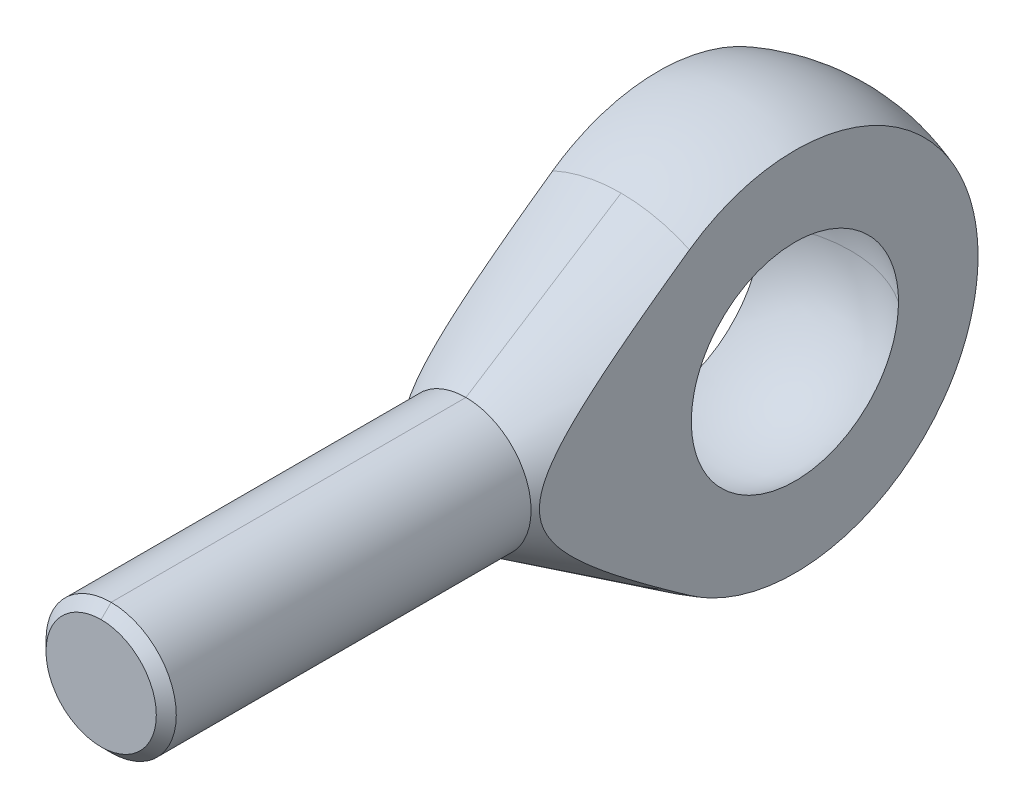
ISO-10303-21;
HEADER;
FILE_DESCRIPTION(('STEP AP214'),'2;1');
FILE_NAME('part.step','',(''),(''),'','','');
FILE_SCHEMA(('AUTOMOTIVE_DESIGN { 1 0 10303 214 1 1 1 1 }'));
ENDSEC;
DATA;
#1=APPLICATION_CONTEXT('core data for automotive mechanical design processes');
#2=APPLICATION_PROTOCOL_DEFINITION('international standard','automotive_design',2000,#1);
#3=PRODUCT_CONTEXT('',#1,'mechanical');
#4=PRODUCT('Part','Part','',(#3));
#5=PRODUCT_RELATED_PRODUCT_CATEGORY('part','',(#4));
#6=PRODUCT_DEFINITION_FORMATION('','',#4);
#7=PRODUCT_DEFINITION_CONTEXT('part definition',#1,'design');
#8=PRODUCT_DEFINITION('design','',#6,#7);
#9=PRODUCT_DEFINITION_SHAPE('','',#8);
#10=(LENGTH_UNIT() NAMED_UNIT(*) SI_UNIT(.MILLI.,.METRE.));
#11=(NAMED_UNIT(*) PLANE_ANGLE_UNIT() SI_UNIT($,.RADIAN.));
#12=(NAMED_UNIT(*) SI_UNIT($,.STERADIAN.) SOLID_ANGLE_UNIT());
#13=UNCERTAINTY_MEASURE_WITH_UNIT(LENGTH_MEASURE(1.E-05),#10,'distance_accuracy_value','');
#14=(GEOMETRIC_REPRESENTATION_CONTEXT(3) GLOBAL_UNCERTAINTY_ASSIGNED_CONTEXT((#13)) GLOBAL_UNIT_ASSIGNED_CONTEXT((#10,
#11,#12)) REPRESENTATION_CONTEXT('',''));
#15=CARTESIAN_POINT('',(0.,0.,0.));
#16=DIRECTION('',(0.,0.,1.));
#17=DIRECTION('',(1.,0.,0.));
#18=AXIS2_PLACEMENT_3D('',#15,#16,#17);
#19=CARTESIAN_POINT('',(0.,2.1165,48.));
#20=DIRECTION('',(0.,0.,1.));
#21=DIRECTION('',(1.,0.,0.));
#22=AXIS2_PLACEMENT_3D('',#19,#20,#21);
#23=PLANE('',#22);
#24=CARTESIAN_POINT('',(0.,0.,47.999999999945));
#25=DIRECTION('',(0.,0.,-1.));
#26=DIRECTION('',(-1.,0.,0.));
#27=AXIS2_PLACEMENT_3D('',#24,#25,#26);
#28=CIRCLE('',#27,4.23300000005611);
#29=CARTESIAN_POINT('',(0.,4.23300000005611,47.999999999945));
#30=VERTEX_POINT('',#29);
#31=CARTESIAN_POINT('',(0.,-4.23300000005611,47.999999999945));
#32=VERTEX_POINT('',#31);
#33=EDGE_CURVE('E76',#30,#32,#28,.T.);
#34=ORIENTED_EDGE('',*,*,#33,.F.);
#35=CARTESIAN_POINT('',(0.,0.,47.999999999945));
#36=DIRECTION('',(0.,0.,-1.));
#37=DIRECTION('',(-1.,0.,0.));
#38=AXIS2_PLACEMENT_3D('',#35,#36,#37);
#39=CIRCLE('',#38,4.23300000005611);
#40=EDGE_CURVE('E17',#32,#30,#39,.T.);
#41=ORIENTED_EDGE('',*,*,#40,.F.);
#42=EDGE_LOOP('',(#34,#41));
#43=FACE_BOUND('',#42,.T.);
#44=ADVANCED_FACE('F14',(#43),#23,.T.);
#45=CARTESIAN_POINT('',(0.,0.,47.2329999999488));
#46=DIRECTION('',(0.,0.,-1.));
#47=DIRECTION('',(-1.,0.,0.));
#48=AXIS2_PLACEMENT_3D('',#45,#46,#47);
#49=CONICAL_SURFACE('',#48,5.0000000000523,0.785398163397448);
#50=DIRECTION('',(0.,0.707106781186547,0.707106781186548));
#51=VECTOR('',#50,1.);
#52=CARTESIAN_POINT('',(-6.11078570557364E-11,-499000.,-498947.767000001));
#53=LINE('',#52,#51);
#54=CARTESIAN_POINT('',(0.,-5.00000000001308,47.2329999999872));
#55=VERTEX_POINT('',#54);
#56=EDGE_CURVE('E87',#32,#55,#53,.F.);
#57=ORIENTED_EDGE('',*,*,#56,.F.);
#58=ORIENTED_EDGE('',*,*,#40,.T.);
#59=DIRECTION('',(0.,-0.707106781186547,0.707106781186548));
#60=VECTOR('',#59,1.);
#61=CARTESIAN_POINT('',(1.22215714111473E-10,499000.,-498947.767000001));
#62=LINE('',#61,#60);
#63=CARTESIAN_POINT('',(0.,5.00000000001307,47.2329999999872));
#64=VERTEX_POINT('',#63);
#65=EDGE_CURVE('E85',#64,#30,#62,.T.);
#66=ORIENTED_EDGE('',*,*,#65,.F.);
#67=CARTESIAN_POINT('',(0.,0.,47.233));
#68=DIRECTION('',(0.,0.,1.));
#69=DIRECTION('',(1.,0.,0.));
#70=AXIS2_PLACEMENT_3D('',#67,#68,#69);
#71=CIRCLE('',#70,5.);
#72=EDGE_CURVE('E93',#55,#64,#71,.F.);
#73=ORIENTED_EDGE('',*,*,#72,.F.);
#74=EDGE_LOOP('',(#57,#58,#66,#73));
#75=FACE_BOUND('',#74,.T.);
#76=ADVANCED_FACE('F83',(#75),#49,.T.);
#77=CARTESIAN_POINT('',(0.,0.,47.2329999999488));
#78=DIRECTION('',(0.,0.,-1.));
#79=DIRECTION('',(-1.,0.,0.));
#80=AXIS2_PLACEMENT_3D('',#77,#78,#79);
#81=CONICAL_SURFACE('',#80,5.0000000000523,0.785398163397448);
#82=ORIENTED_EDGE('',*,*,#56,.T.);
#83=CARTESIAN_POINT('',(0.,0.,47.233));
#84=DIRECTION('',(0.,0.,1.));
#85=DIRECTION('',(1.,0.,0.));
#86=AXIS2_PLACEMENT_3D('',#83,#84,#85);
#87=CIRCLE('',#86,5.);
#88=EDGE_CURVE('E91',#64,#55,#87,.F.);
#89=ORIENTED_EDGE('',*,*,#88,.F.);
#90=ORIENTED_EDGE('',*,*,#65,.T.);
#91=ORIENTED_EDGE('',*,*,#33,.T.);
#92=EDGE_LOOP('',(#82,#89,#90,#91));
#93=FACE_BOUND('',#92,.T.);
#94=ADVANCED_FACE('F89',(#93),#81,.T.);
#95=CARTESIAN_POINT('',(0.,0.,33.6165));
#96=DIRECTION('',(0.,0.,1.));
#97=DIRECTION('',(1.,0.,0.));
#98=AXIS2_PLACEMENT_3D('',#95,#96,#97);
#99=CYLINDRICAL_SURFACE('',#98,5.);
#100=DIRECTION('',(0.,0.,1.));
#101=VECTOR('',#100,1.);
#102=CARTESIAN_POINT('',(0.,-5.,33.6165));
#103=LINE('',#102,#101);
#104=CARTESIAN_POINT('',(0.,-5.,20.));
#105=VERTEX_POINT('',#104);
#106=EDGE_CURVE('E105',#55,#105,#103,.F.);
#107=ORIENTED_EDGE('',*,*,#106,.F.);
#108=ORIENTED_EDGE('',*,*,#72,.T.);
#109=DIRECTION('',(0.,0.,1.));
#110=VECTOR('',#109,1.);
#111=CARTESIAN_POINT('',(0.,5.,33.6165));
#112=LINE('',#111,#110);
#113=CARTESIAN_POINT('',(0.,5.,20.));
#114=VERTEX_POINT('',#113);
#115=EDGE_CURVE('E262',#114,#64,#112,.T.);
#116=ORIENTED_EDGE('',*,*,#115,.F.);
#117=CARTESIAN_POINT('',(0.,0.,20.));
#118=DIRECTION('',(0.,0.,-1.));
#119=DIRECTION('',(0.,1.,0.));
#120=AXIS2_PLACEMENT_3D('',#117,#118,#119);
#121=CIRCLE('',#120,5.);
#122=EDGE_CURVE('E104',#105,#114,#121,.T.);
#123=ORIENTED_EDGE('',*,*,#122,.F.);
#124=EDGE_LOOP('',(#107,#108,#116,#123));
#125=FACE_BOUND('',#124,.T.);
#126=ADVANCED_FACE('F133',(#125),#99,.T.);
#127=CARTESIAN_POINT('',(-5.25,30.,20.));
#128=DIRECTION('',(1.,0.,0.));
#129=DIRECTION('',(0.,0.,-1.));
#130=AXIS2_PLACEMENT_3D('',#127,#128,#129);
#131=PLANE('',#130);
#132=CARTESIAN_POINT('',(-5.25,0.,-14.0512454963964));
#133=CARTESIAN_POINT('',(-5.25,0.395197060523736,-14.0512879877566));
#134=CARTESIAN_POINT('',(-5.25,0.790388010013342,-14.0345746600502));
#135=CARTESIAN_POINT('',(-5.25,1.57794256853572,-13.9679432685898));
#136=CARTESIAN_POINT('',(-5.25,1.97030631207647,-13.9180267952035));
#137=CARTESIAN_POINT('',(-5.25,2.74915325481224,-13.7853430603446));
#138=CARTESIAN_POINT('',(-5.25,3.13564042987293,-13.7025991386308));
#139=CARTESIAN_POINT('',(-5.25,3.90026972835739,-13.5048624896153));
#140=CARTESIAN_POINT('',(-5.25,4.27841195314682,-13.3898701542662));
#141=CARTESIAN_POINT('',(-5.25,5.02384567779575,-13.1283877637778));
#142=CARTESIAN_POINT('',(-5.25,5.39113196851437,-12.9818828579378));
#143=CARTESIAN_POINT('',(-5.25,6.11205566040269,-12.6584501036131));
#144=CARTESIAN_POINT('',(-5.25,6.46569305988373,-12.4815222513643));
#145=CARTESIAN_POINT('',(-5.25,7.15673858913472,-12.098537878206));
#146=CARTESIAN_POINT('',(-5.25,7.49414978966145,-11.8924868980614));
#147=CARTESIAN_POINT('',(-5.25,8.15041495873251,-11.4526966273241));
#148=CARTESIAN_POINT('',(-5.25,8.46926901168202,-11.2189574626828));
#149=CARTESIAN_POINT('',(-5.25,9.0861624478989,-10.7254456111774));
#150=CARTESIAN_POINT('',(-5.25,9.38420133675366,-10.4656723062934));
#151=CARTESIAN_POINT('',(-5.25,9.95733805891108,-9.92194290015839));
#152=CARTESIAN_POINT('',(-5.25,10.2324358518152,-9.63798675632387));
#153=CARTESIAN_POINT('',(-5.25,10.7577729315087,-9.04786712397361));
#154=CARTESIAN_POINT('',(-5.25,11.0080085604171,-8.74170037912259));
#155=CARTESIAN_POINT('',(-5.25,11.4817959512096,-8.10937356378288));
#156=CARTESIAN_POINT('',(-5.25,11.7053477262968,-7.78321350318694));
#157=CARTESIAN_POINT('',(-5.25,12.1241708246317,-7.11323055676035));
#158=CARTESIAN_POINT('',(-5.25,12.3194431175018,-6.76940827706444));
#159=CARTESIAN_POINT('',(-5.25,12.680328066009,-6.06653503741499));
#160=CARTESIAN_POINT('',(-5.25,12.8459407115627,-5.70748407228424));
#161=CARTESIAN_POINT('',(-5.25,13.1463170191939,-4.97673504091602));
#162=CARTESIAN_POINT('',(-5.25,13.2810830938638,-4.6050379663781));
#163=CARTESIAN_POINT('',(-5.25,13.5188246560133,-3.85161294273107));
#164=CARTESIAN_POINT('',(-5.25,13.6218001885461,-3.4698850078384));
#165=CARTESIAN_POINT('',(-5.25,13.7952236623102,-2.69913461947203));
#166=CARTESIAN_POINT('',(-5.25,13.8656735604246,-2.3101126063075));
#167=CARTESIAN_POINT('',(-5.25,13.9735544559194,-1.52751471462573));
#168=CARTESIAN_POINT('',(-5.25,14.010985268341,-1.13393881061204));
#169=CARTESIAN_POINT('',(-5.25,14.0525654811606,-0.344952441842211));
#170=CARTESIAN_POINT('',(-5.25,14.0567081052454,0.0504583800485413));
#171=CARTESIAN_POINT('',(-5.25,14.0316649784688,0.840214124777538));
#172=CARTESIAN_POINT('',(-5.25,14.0024799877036,1.23455907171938));
#173=CARTESIAN_POINT('',(-5.25,13.9109711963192,2.0195526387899));
#174=CARTESIAN_POINT('',(-5.25,13.8486335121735,2.4101996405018));
#175=CARTESIAN_POINT('',(-5.25,13.6912543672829,3.18484956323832));
#176=CARTESIAN_POINT('',(-5.25,13.5962129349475,3.5688524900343));
#177=CARTESIAN_POINT('',(-5.25,13.374194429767,4.32716718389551));
#178=CARTESIAN_POINT('',(-5.25,13.2472437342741,4.70148667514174));
#179=CARTESIAN_POINT('',(-5.25,12.9623220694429,5.43797388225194));
#180=CARTESIAN_POINT('',(-5.25,12.8043625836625,5.80014603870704));
#181=CARTESIAN_POINT('',(-5.25,12.4668170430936,6.49285380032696));
#182=CARTESIAN_POINT('',(-5.25,12.2886329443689,6.82407352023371));
#183=CARTESIAN_POINT('',(-5.25,11.9066673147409,7.47059139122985));
#184=CARTESIAN_POINT('',(-5.25,11.7029331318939,7.78591751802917));
#185=CARTESIAN_POINT('',(-5.25,11.4868578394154,8.09256430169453));
#186=B_SPLINE_CURVE_WITH_KNOTS('',3,(#132,#133,#134,#135,#136,#137,#138,#139,#140,#141,#142,
#143,#144,#145,#146,#147,#148,#149,#150,#151,#152,#153,#154,#155,#156,#157,#158,#159,#160,#161,
#162,#163,#164,#165,#166,#167,#168,#169,#170,#171,#172,#173,#174,#175,#176,#177,#178,#179,#180,
#181,#182,#183,#184,#185),.UNSPECIFIED.,.F.,.F.,(4,2,2,2,2,2,2,2,2,2,2,2,2,2,2,2,2,2,2,2,2,2,2,
2,2,2,4),(0.,1.18522930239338,2.37040183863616,3.55473324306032,4.73905025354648,
5.92392661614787,7.10880312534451,8.29345451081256,9.47810050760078,10.6627746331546,
11.8474508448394,13.0323010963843,14.2171507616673,15.4019597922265,16.5867692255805,
17.7714859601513,18.9562010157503,20.1408447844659,21.3254951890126,22.5103867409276,
23.6952512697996,24.8806123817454,26.0659724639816,27.2503558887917,28.4343015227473,
29.5614196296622,30.6864790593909),.UNSPECIFIED.);
#187=CARTESIAN_POINT('',(-5.25,0.,-14.0512454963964));
#188=VERTEX_POINT('',#187);
#189=CARTESIAN_POINT('',(-5.25,11.4868578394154,8.09256430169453));
#190=VERTEX_POINT('',#189);
#191=EDGE_CURVE('E313',#188,#190,#186,.T.);
#192=ORIENTED_EDGE('',*,*,#191,.F.);
#193=CARTESIAN_POINT('',(-5.25,-11.4868578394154,8.09256430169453));
#194=CARTESIAN_POINT('',(-5.25,-11.7144992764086,7.76951617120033));
#195=CARTESIAN_POINT('',(-5.25,-11.9284393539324,7.4368228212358));
#196=CARTESIAN_POINT('',(-5.25,-12.3275463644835,6.75462378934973));
#197=CARTESIAN_POINT('',(-5.25,-12.5127146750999,6.40511891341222));
#198=CARTESIAN_POINT('',(-5.25,-12.8528090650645,5.69199666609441));
#199=CARTESIAN_POINT('',(-5.25,-13.0077565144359,5.32838948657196));
#200=CARTESIAN_POINT('',(-5.25,-13.2864819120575,4.58942406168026));
#201=CARTESIAN_POINT('',(-5.25,-13.4102602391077,4.21406595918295));
#202=CARTESIAN_POINT('',(-5.25,-13.6258183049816,3.45407964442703));
#203=CARTESIAN_POINT('',(-5.25,-13.717582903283,3.06944713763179));
#204=CARTESIAN_POINT('',(-5.25,-13.8683805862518,2.29381850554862));
#205=CARTESIAN_POINT('',(-5.25,-13.9274136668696,1.90282237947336));
#206=CARTESIAN_POINT('',(-5.25,-14.0123202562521,1.11732137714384));
#207=CARTESIAN_POINT('',(-5.25,-14.0382000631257,0.72281718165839));
#208=CARTESIAN_POINT('',(-5.25,-14.0566368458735,-0.0669673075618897));
#209=CARTESIAN_POINT('',(-5.25,-14.0491939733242,-0.462247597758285));
#210=CARTESIAN_POINT('',(-5.25,-14.001038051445,-1.25078578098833));
#211=CARTESIAN_POINT('',(-5.25,-13.9603242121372,-1.64404362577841));
#212=CARTESIAN_POINT('',(-5.25,-13.8459146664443,-2.42573271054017));
#213=CARTESIAN_POINT('',(-5.25,-13.7722189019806,-2.81416394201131));
#214=CARTESIAN_POINT('',(-5.25,-13.5923561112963,-3.58349456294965));
#215=CARTESIAN_POINT('',(-5.25,-13.4861843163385,-3.96439283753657));
#216=CARTESIAN_POINT('',(-5.25,-13.2421281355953,-4.71589019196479));
#217=CARTESIAN_POINT('',(-5.25,-13.1042437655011,-5.08648927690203));
#218=CARTESIAN_POINT('',(-5.25,-12.7977480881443,-5.81474083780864));
#219=CARTESIAN_POINT('',(-5.25,-12.629137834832,-6.17239375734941));
#220=CARTESIAN_POINT('',(-5.25,-12.2623859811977,-6.8722236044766));
#221=CARTESIAN_POINT('',(-5.25,-12.0642443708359,-7.21440052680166));
#222=CARTESIAN_POINT('',(-5.25,-11.639855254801,-7.88081927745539));
#223=CARTESIAN_POINT('',(-5.25,-11.4136099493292,-8.20506250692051));
#224=CARTESIAN_POINT('',(-5.25,-10.9346099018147,-8.83333734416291));
#225=CARTESIAN_POINT('',(-5.25,-10.6818551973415,-9.1373689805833));
#226=CARTESIAN_POINT('',(-5.25,-10.1516488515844,-9.72304217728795));
#227=CARTESIAN_POINT('',(-5.25,-9.87419869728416,-10.004685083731));
#228=CARTESIAN_POINT('',(-5.25,-9.29655896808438,-10.5436007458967));
#229=CARTESIAN_POINT('',(-5.25,-8.99636926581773,-10.8008733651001));
#230=CARTESIAN_POINT('',(-5.25,-8.37532227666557,-11.2892677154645));
#231=CARTESIAN_POINT('',(-5.25,-8.05446079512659,-11.5203841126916));
#232=CARTESIAN_POINT('',(-5.25,-7.39441431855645,-11.9547571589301));
#233=CARTESIAN_POINT('',(-5.25,-7.05522974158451,-12.1580144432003));
#234=CARTESIAN_POINT('',(-5.25,-6.36079661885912,-12.5353092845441));
#235=CARTESIAN_POINT('',(-5.25,-6.00554140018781,-12.7093345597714));
#236=CARTESIAN_POINT('',(-5.25,-5.28162732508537,-13.0268233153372));
#237=CARTESIAN_POINT('',(-5.25,-4.91296848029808,-13.1702868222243));
#238=CARTESIAN_POINT('',(-5.25,-4.16518052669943,-13.4255250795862));
#239=CARTESIAN_POINT('',(-5.25,-3.7860602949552,-13.5373258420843));
#240=CARTESIAN_POINT('',(-5.25,-3.01988830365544,-13.728569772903));
#241=CARTESIAN_POINT('',(-5.25,-2.63283952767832,-13.8080248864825));
#242=CARTESIAN_POINT('',(-5.25,-1.8721493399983,-13.931034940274));
#243=CARTESIAN_POINT('',(-5.25,-1.49875609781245,-13.9761299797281));
#244=CARTESIAN_POINT('',(-5.25,-0.750243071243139,-14.0362244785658));
#245=CARTESIAN_POINT('',(-5.25,-0.375127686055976,-14.0512787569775));
#246=CARTESIAN_POINT('',(-5.25,0.,-14.0512454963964));
#247=B_SPLINE_CURVE_WITH_KNOTS('',3,(#193,#194,#195,#196,#197,#198,#199,#200,#201,#202,#203,
#204,#205,#206,#207,#208,#209,#210,#211,#212,#213,#214,#215,#216,#217,#218,#219,#220,#221,#222,
#223,#224,#225,#226,#227,#228,#229,#230,#231,#232,#233,#234,#235,#236,#237,#238,#239,#240,#241,
#242,#243,#244,#245,#246),.UNSPECIFIED.,.F.,.F.,(4,2,2,2,2,2,2,2,2,2,2,2,2,2,2,2,2,2,2,2,2,2,2,
2,2,2,4),(0.,1.18522930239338,2.37040183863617,3.55473324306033,4.73905025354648,
5.92392661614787,7.10880312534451,8.29345451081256,9.47810050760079,10.6627746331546,
11.8474508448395,13.0323010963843,14.2171507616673,15.4019597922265,16.5867692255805,
17.7714859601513,18.9562010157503,20.1408447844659,21.3254951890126,22.5103867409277,
23.6952512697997,24.8806123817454,26.0659724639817,27.2503558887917,28.4343015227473,
29.5614196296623,30.6864790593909),.UNSPECIFIED.);
#248=CARTESIAN_POINT('',(-5.25,-11.4868578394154,8.09256430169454));
#249=VERTEX_POINT('',#248);
#250=EDGE_CURVE('E244',#249,#188,#247,.T.);
#251=ORIENTED_EDGE('',*,*,#250,.F.);
#252=CARTESIAN_POINT('',(-5.25,11.4868578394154,8.09256430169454));
#253=CARTESIAN_POINT('',(-5.25,11.2062231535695,8.4908315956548));
#254=CARTESIAN_POINT('',(-5.25,10.9244649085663,8.88831506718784));
#255=CARTESIAN_POINT('',(-5.25,10.3579590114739,9.68123397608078));
#256=CARTESIAN_POINT('',(-5.25,10.0732109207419,10.0766690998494));
#257=CARTESIAN_POINT('',(-5.25,9.49805963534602,10.8676515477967));
#258=CARTESIAN_POINT('',(-5.25,9.20763080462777,11.2631802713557));
#259=CARTESIAN_POINT('',(-5.25,8.6220475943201,12.0506723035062));
#260=CARTESIAN_POINT('',(-5.25,8.32689365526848,12.4426359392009));
#261=CARTESIAN_POINT('',(-5.25,7.73029396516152,13.2219255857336));
#262=CARTESIAN_POINT('',(-5.25,7.42884665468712,13.6092504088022));
#263=CARTESIAN_POINT('',(-5.25,6.97032405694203,14.1852766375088));
#264=CARTESIAN_POINT('',(-5.25,6.81640080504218,14.3764871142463));
#265=CARTESIAN_POINT('',(-5.25,6.50606681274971,14.7568764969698));
#266=CARTESIAN_POINT('',(-5.25,6.3496561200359,14.9460554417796));
#267=CARTESIAN_POINT('',(-5.25,6.03443192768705,15.3212860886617));
#268=CARTESIAN_POINT('',(-5.25,5.87562865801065,15.5073463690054));
#269=CARTESIAN_POINT('',(-5.25,5.55451665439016,15.876410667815));
#270=CARTESIAN_POINT('',(-5.25,5.39220808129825,16.0594148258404));
#271=CARTESIAN_POINT('',(-5.25,5.06341198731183,16.4214894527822));
#272=CARTESIAN_POINT('',(-5.25,4.89692639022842,16.6005616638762));
#273=CARTESIAN_POINT('',(-5.25,4.55877225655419,16.9537275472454));
#274=CARTESIAN_POINT('',(-5.25,4.38710445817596,17.1278219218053));
#275=CARTESIAN_POINT('',(-5.25,4.09468952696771,17.4134051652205));
#276=CARTESIAN_POINT('',(-5.25,3.97570795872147,17.5266998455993));
#277=CARTESIAN_POINT('',(-5.25,3.73435405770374,17.7496414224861));
#278=CARTESIAN_POINT('',(-5.25,3.6119816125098,17.8592881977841));
#279=CARTESIAN_POINT('',(-5.25,3.36289061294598,18.0743985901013));
#280=CARTESIAN_POINT('',(-5.25,3.23615906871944,18.1798472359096));
#281=CARTESIAN_POINT('',(-5.25,2.978089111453,18.384981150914));
#282=CARTESIAN_POINT('',(-5.25,2.84675075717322,18.4846664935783));
#283=CARTESIAN_POINT('',(-5.25,2.57679359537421,18.6780727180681));
#284=CARTESIAN_POINT('',(-5.25,2.4380964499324,18.7716851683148));
#285=CARTESIAN_POINT('',(-5.25,2.1544273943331,18.9490921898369));
#286=CARTESIAN_POINT('',(-5.25,2.00945358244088,19.0328837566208));
#287=CARTESIAN_POINT('',(-5.25,1.71348227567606,19.1872175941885));
#288=CARTESIAN_POINT('',(-5.25,1.5625196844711,19.2578259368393));
#289=CARTESIAN_POINT('',(-5.25,1.25394611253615,19.3825635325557));
#290=CARTESIAN_POINT('',(-5.25,1.09634276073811,19.4367111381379));
#291=CARTESIAN_POINT('',(-5.25,0.839438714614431,19.5070878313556));
#292=CARTESIAN_POINT('',(-5.25,0.741906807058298,19.5298306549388));
#293=CARTESIAN_POINT('',(-5.25,0.545306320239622,19.5671610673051));
#294=CARTESIAN_POINT('',(-5.25,0.446238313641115,19.5817516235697));
#295=CARTESIAN_POINT('',(-5.25,0.247258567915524,19.6022152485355));
#296=CARTESIAN_POINT('',(-5.25,0.147347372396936,19.6080935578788));
#297=CARTESIAN_POINT('',(-5.25,-0.05260439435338,19.6109092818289));
#298=CARTESIAN_POINT('',(-5.25,-0.152644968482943,19.6078464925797));
#299=CARTESIAN_POINT('',(-5.25,-0.351882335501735,19.5929170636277));
#300=CARTESIAN_POINT('',(-5.25,-0.451080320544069,19.581066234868));
#301=CARTESIAN_POINT('',(-5.25,-0.648140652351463,19.5490519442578));
#302=CARTESIAN_POINT('',(-5.25,-0.746002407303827,19.5288849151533));
#303=CARTESIAN_POINT('',(-5.25,-1.03685342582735,19.4569062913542));
#304=CARTESIAN_POINT('',(-5.25,-1.22706157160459,19.3936212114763));
#305=CARTESIAN_POINT('',(-5.25,-1.56995693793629,19.2546531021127));
#306=CARTESIAN_POINT('',(-5.25,-1.72401963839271,19.182209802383));
#307=CARTESIAN_POINT('',(-5.25,-2.02529621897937,19.0240899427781));
#308=CARTESIAN_POINT('',(-5.25,-2.17250433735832,18.9384025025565));
#309=CARTESIAN_POINT('',(-5.25,-2.46110228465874,18.7565853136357));
#310=CARTESIAN_POINT('',(-5.25,-2.60246532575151,18.660413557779));
#311=CARTESIAN_POINT('',(-5.25,-2.81021901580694,18.510348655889));
#312=CARTESIAN_POINT('',(-5.25,-2.87874425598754,18.4593679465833));
#313=CARTESIAN_POINT('',(-5.25,-3.01448083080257,18.3556862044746));
#314=CARTESIAN_POINT('',(-5.25,-3.08169217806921,18.3029851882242));
#315=CARTESIAN_POINT('',(-5.25,-3.27380703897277,18.1487902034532));
#316=CARTESIAN_POINT('',(-5.25,-3.39716240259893,18.0453651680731));
#317=CARTESIAN_POINT('',(-5.25,-3.64015991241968,17.8342261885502));
#318=CARTESIAN_POINT('',(-5.25,-3.75980138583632,17.7265114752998));
#319=CARTESIAN_POINT('',(-5.25,-3.99593974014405,17.5075548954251));
#320=CARTESIAN_POINT('',(-5.25,-4.11243465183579,17.3963109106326));
#321=CARTESIAN_POINT('',(-5.25,-4.34264232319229,17.1709751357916));
#322=CARTESIAN_POINT('',(-5.25,-4.45635489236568,17.056883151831));
#323=CARTESIAN_POINT('',(-5.25,-4.79444382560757,16.7105176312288));
#324=CARTESIAN_POINT('',(-5.25,-5.01519140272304,16.4747011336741));
#325=CARTESIAN_POINT('',(-5.25,-5.44923239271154,15.9965063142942));
#326=CARTESIAN_POINT('',(-5.25,-5.66252821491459,15.7541301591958));
#327=CARTESIAN_POINT('',(-5.25,-6.08448823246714,15.2631626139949));
#328=CARTESIAN_POINT('',(-5.25,-6.29312201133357,15.014545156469));
#329=CARTESIAN_POINT('',(-5.25,-6.70580589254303,14.513517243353));
#330=CARTESIAN_POINT('',(-5.25,-6.90985566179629,14.2611065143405));
#331=CARTESIAN_POINT('',(-5.25,-7.3139606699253,13.7537052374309));
#332=CARTESIAN_POINT('',(-5.25,-7.51402122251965,13.4987189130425));
#333=CARTESIAN_POINT('',(-5.25,-7.91111510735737,12.9864143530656));
#334=CARTESIAN_POINT('',(-5.25,-8.10814851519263,12.7290961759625));
#335=CARTESIAN_POINT('',(-5.25,-8.57799424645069,12.1093135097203));
#336=CARTESIAN_POINT('',(-5.25,-8.84960883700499,11.7459416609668));
#337=CARTESIAN_POINT('',(-5.25,-9.38910957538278,11.0162395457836));
#338=CARTESIAN_POINT('',(-5.25,-9.65699430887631,10.6499082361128));
#339=CARTESIAN_POINT('',(-5.25,-10.1866189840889,9.91929954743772));
#340=CARTESIAN_POINT('',(-5.25,-10.4483941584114,9.55504767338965));
#341=CARTESIAN_POINT('',(-5.25,-10.9693850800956,8.82494186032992));
#342=CARTESIAN_POINT('',(-5.25,-11.228601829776,8.45908863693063));
#343=CARTESIAN_POINT('',(-5.25,-11.4868578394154,8.09256430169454));
#344=B_SPLINE_CURVE_WITH_KNOTS('',3,(#252,#253,#254,#255,#256,#257,#258,#259,#260,#261,#262,
#263,#264,#265,#266,#267,#268,#269,#270,#271,#272,#273,#274,#275,#276,#277,#278,#279,#280,#281,
#282,#283,#284,#285,#286,#287,#288,#289,#290,#291,#292,#293,#294,#295,#296,#297,#298,#299,#300,
#301,#302,#303,#304,#305,#306,#307,#308,#309,#310,#311,#312,#313,#314,#315,#316,#317,#318,#319,
#320,#321,#322,#323,#324,#325,#326,#327,#328,#329,#330,#331,#332,#333,#334,#335,#336,#337,#338,
#339,#340,#341,#342,#343),.UNSPECIFIED.,.F.,.F.,(4,2,2,2,2,2,2,2,2,2,2,2,2,2,2,2,2,2,2,2,2,2,2,
2,2,2,2,2,2,2,2,2,2,2,2,2,2,2,2,2,2,2,2,2,2,4),(0.,1.4616347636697,2.9234870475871,
4.39557491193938,5.86752631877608,7.33984689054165,8.07623014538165,8.81259930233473,
9.5464113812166,10.2801898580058,11.0136363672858,11.7469788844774,12.2397989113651,
12.7326352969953,13.2270953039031,13.7215490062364,14.2232273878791,14.7250588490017,
15.2243034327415,15.7229893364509,16.0231370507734,16.3231754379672,16.6230332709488,
16.9228979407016,17.2222244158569,17.5216794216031,18.1207288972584,18.630760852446,
19.1412140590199,19.6537933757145,19.909999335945,20.1662028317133,20.648996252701,
21.1318766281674,21.6150525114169,22.0982613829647,23.0670679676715,24.0355583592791,
25.0091645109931,25.9828411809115,26.9551201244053,27.9273747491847,29.2883405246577,
30.6498090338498,31.9954766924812,33.3405943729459),.UNSPECIFIED.);
#345=EDGE_CURVE('E96',#190,#249,#344,.T.);
#346=ORIENTED_EDGE('',*,*,#345,.F.);
#347=EDGE_LOOP('',(#192,#251,#346));
#348=FACE_BOUND('',#347,.T.);
#349=CARTESIAN_POINT('',(-5.25,0.,-7.94752319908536));
#350=CARTESIAN_POINT('',(-5.25,0.223526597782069,-7.9475472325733));
#351=CARTESIAN_POINT('',(-5.25,0.447049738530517,-7.93809407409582));
#352=CARTESIAN_POINT('',(-5.25,0.892496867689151,-7.9004069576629));
#353=CARTESIAN_POINT('',(-5.25,1.11442093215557,-7.87217389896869));
#354=CARTESIAN_POINT('',(-5.25,1.55494449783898,-7.79712692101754));
#355=CARTESIAN_POINT('',(-5.25,1.77354622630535,-7.75032607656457));
#356=CARTESIAN_POINT('',(-5.25,2.2060296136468,-7.63848401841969));
#357=CARTESIAN_POINT('',(-5.25,2.41991132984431,-7.57344302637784));
#358=CARTESIAN_POINT('',(-5.25,2.84153554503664,-7.42554616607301));
#359=CARTESIAN_POINT('',(-5.25,3.04927515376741,-7.34268205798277));
#360=CARTESIAN_POINT('',(-5.25,3.45703771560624,-7.15974507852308));
#361=CARTESIAN_POINT('',(-5.25,3.65706054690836,-7.05967193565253));
#362=CARTESIAN_POINT('',(-5.25,4.04792416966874,-6.84305119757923));
#363=CARTESIAN_POINT('',(-5.25,4.2387668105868,-6.72650693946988));
#364=CARTESIAN_POINT('',(-5.25,4.6099559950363,-6.47775770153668));
#365=CARTESIAN_POINT('',(-5.25,4.79030258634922,-6.34555279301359));
#366=CARTESIAN_POINT('',(-5.25,5.13919270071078,-6.06644234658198));
#367=CARTESIAN_POINT('',(-5.25,5.30773797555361,-5.91953899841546));
#368=CARTESIAN_POINT('',(-5.25,5.63191348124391,-5.61200582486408));
#369=CARTESIAN_POINT('',(-5.25,5.78753921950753,-5.45137126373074));
#370=CARTESIAN_POINT('',(-5.25,6.08469961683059,-5.11756647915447));
#371=CARTESIAN_POINT('',(-5.25,6.22623467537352,-4.94439661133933));
#372=CARTESIAN_POINT('',(-5.25,6.49421448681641,-4.58674566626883));
#373=CARTESIAN_POINT('',(-5.25,6.62065900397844,-4.40226441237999));
#374=CARTESIAN_POINT('',(-5.25,6.85754858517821,-4.02331688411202));
#375=CARTESIAN_POINT('',(-5.25,6.9679946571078,-3.8288512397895));
#376=CARTESIAN_POINT('',(-5.25,7.17211385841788,-3.43130242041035));
#377=CARTESIAN_POINT('',(-5.25,7.26578661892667,-3.22821905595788));
#378=CARTESIAN_POINT('',(-5.25,7.43566913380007,-2.8149339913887));
#379=CARTESIAN_POINT('',(-5.25,7.51188320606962,-2.60473406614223));
#380=CARTESIAN_POINT('',(-5.25,7.64635965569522,-2.17858835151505));
#381=CARTESIAN_POINT('',(-5.25,7.70461582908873,-1.9626406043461));
#382=CARTESIAN_POINT('',(-5.25,7.80271856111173,-1.52664013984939));
#383=CARTESIAN_POINT('',(-5.25,7.84256811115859,-1.30658809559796));
#384=CARTESIAN_POINT('',(-5.25,7.90358893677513,-0.863904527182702));
#385=CARTESIAN_POINT('',(-5.25,7.92475981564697,-0.641272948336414));
#386=CARTESIAN_POINT('',(-5.25,7.94827148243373,-0.195014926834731));
#387=CARTESIAN_POINT('',(-5.25,7.95061203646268,0.0286115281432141));
#388=CARTESIAN_POINT('',(-5.25,7.93644580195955,0.475266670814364));
#389=CARTESIAN_POINT('',(-5.25,7.91993901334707,0.698295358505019));
#390=CARTESIAN_POINT('',(-5.25,7.86819542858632,1.14216948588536));
#391=CARTESIAN_POINT('',(-5.25,7.83295861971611,1.36301492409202));
#392=CARTESIAN_POINT('',(-5.25,7.74400646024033,1.80094760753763));
#393=CARTESIAN_POINT('',(-5.25,7.69029150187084,2.01803493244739));
#394=CARTESIAN_POINT('',(-5.25,7.56475342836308,2.44695153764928));
#395=CARTESIAN_POINT('',(-5.25,7.49292705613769,2.65877986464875));
#396=CARTESIAN_POINT('',(-5.25,7.33170963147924,3.07555942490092));
#397=CARTESIAN_POINT('',(-5.25,7.24232464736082,3.28051300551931));
#398=CARTESIAN_POINT('',(-5.25,7.04658897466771,3.68220539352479));
#399=CARTESIAN_POINT('',(-5.25,6.94023472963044,3.87894246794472));
#400=CARTESIAN_POINT('',(-5.25,6.71133268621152,4.26275312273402));
#401=CARTESIAN_POINT('',(-5.25,6.58878524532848,4.44982691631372));
#402=CARTESIAN_POINT('',(-5.25,6.32837022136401,4.81298014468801));
#403=CARTESIAN_POINT('',(-5.25,6.19050310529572,4.98905991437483));
#404=CARTESIAN_POINT('',(-5.25,5.90042809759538,5.32897684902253));
#405=CARTESIAN_POINT('',(-5.25,5.74822043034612,5.49281420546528));
#406=CARTESIAN_POINT('',(-5.25,5.43053715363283,5.80709193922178));
#407=CARTESIAN_POINT('',(-5.25,5.26506093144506,5.95753169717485));
#408=CARTESIAN_POINT('',(-5.25,4.92208256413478,6.24388655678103));
#409=CARTESIAN_POINT('',(-5.25,4.74458459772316,6.37980666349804));
#410=CARTESIAN_POINT('',(-5.25,4.3786799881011,6.63628120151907));
#411=CARTESIAN_POINT('',(-5.25,4.19026786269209,6.75682781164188));
#412=CARTESIAN_POINT('',(-5.25,3.80396254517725,6.98161388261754));
#413=CARTESIAN_POINT('',(-5.25,3.60606964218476,7.08585384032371));
#414=CARTESIAN_POINT('',(-5.25,3.20207688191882,7.27735056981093));
#415=CARTESIAN_POINT('',(-5.25,2.99597189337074,7.36459651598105));
#416=CARTESIAN_POINT('',(-5.25,2.57714314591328,7.52139988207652));
#417=CARTESIAN_POINT('',(-5.25,2.36441953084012,7.59095768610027));
#418=CARTESIAN_POINT('',(-5.25,1.93414683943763,7.71181419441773));
#419=CARTESIAN_POINT('',(-5.25,1.71660428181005,7.76313613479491));
#420=CARTESIAN_POINT('',(-5.25,1.2780566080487,7.84726123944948));
#421=CARTESIAN_POINT('',(-5.25,1.05705324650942,7.88007349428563));
#422=CARTESIAN_POINT('',(-5.25,0.696307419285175,7.91819240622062));
#423=CARTESIAN_POINT('',(-5.25,0.557142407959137,7.92919846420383));
#424=CARTESIAN_POINT('',(-5.25,0.278656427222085,7.94385859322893));
#425=CARTESIAN_POINT('',(-5.25,0.139336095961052,7.94752478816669));
#426=CARTESIAN_POINT('',(-5.25,-1.46150452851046E-12,7.94752319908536));
#427=B_SPLINE_CURVE_WITH_KNOTS('',3,(#349,#350,#351,#352,#353,#354,#355,#356,#357,#358,#359,
#360,#361,#362,#363,#364,#365,#366,#367,#368,#369,#370,#371,#372,#373,#374,#375,#376,#377,#378,
#379,#380,#381,#382,#383,#384,#385,#386,#387,#388,#389,#390,#391,#392,#393,#394,#395,#396,#397,
#398,#399,#400,#401,#402,#403,#404,#405,#406,#407,#408,#409,#410,#411,#412,#413,#414,#415,#416,
#417,#418,#419,#420,#421,#422,#423,#424,#425,#426),.UNSPECIFIED.,.F.,.F.,(4,2,2,2,2,2,2,2,2,2,2,
2,2,2,2,2,2,2,2,2,2,2,2,2,2,2,2,2,2,2,2,2,2,2,2,2,2,2,4),(0.,0.670375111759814,1.34071812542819,
2.01058994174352,2.68045361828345,3.35062764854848,4.02081225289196,4.69086127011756,
5.36090723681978,6.03085352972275,6.70103181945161,7.37119110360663,8.04136085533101,
8.7114883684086,9.38163061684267,10.0516069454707,10.7218144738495,11.3919130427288,
12.0620258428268,12.7321469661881,13.4022680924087,14.0723896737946,14.7424970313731,
15.4127249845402,16.0827217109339,16.7528590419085,17.4229815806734,18.0930836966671,
18.7631753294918,19.4332979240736,20.1031887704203,20.773419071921,21.443628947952,
22.1142643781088,22.7848852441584,23.454648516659,24.1240825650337,24.5427033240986,
24.9606320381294),.UNSPECIFIED.);
#428=CARTESIAN_POINT('',(-5.25,0.,-7.94752319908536));
#429=VERTEX_POINT('',#428);
#430=CARTESIAN_POINT('',(-5.25,-5.11258630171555E-12,7.94752319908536));
#431=VERTEX_POINT('',#430);
#432=EDGE_CURVE('E333',#429,#431,#427,.T.);
#433=ORIENTED_EDGE('',*,*,#432,.T.);
#434=CARTESIAN_POINT('',(-5.25,-1.46150452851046E-12,7.94752319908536));
#435=CARTESIAN_POINT('',(-5.25,-0.223532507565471,7.94754723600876));
#436=CARTESIAN_POINT('',(-5.25,-0.44706156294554,7.93809357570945));
#437=CARTESIAN_POINT('',(-5.25,-0.892520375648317,7.90040446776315));
#438=CARTESIAN_POINT('',(-5.25,-1.11445020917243,7.87216992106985));
#439=CARTESIAN_POINT('',(-5.25,-1.55497343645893,7.79712098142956));
#440=CARTESIAN_POINT('',(-5.25,-1.77356922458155,7.75032064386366));
#441=CARTESIAN_POINT('',(-5.25,-2.20604092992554,7.63848057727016));
#442=CARTESIAN_POINT('',(-5.25,-2.41991690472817,7.57344107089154));
#443=CARTESIAN_POINT('',(-5.25,-2.84153337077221,7.42554692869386));
#444=CARTESIAN_POINT('',(-5.25,-3.04927087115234,7.34268376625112));
#445=CARTESIAN_POINT('',(-5.25,-3.45702944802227,7.1597490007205));
#446=CARTESIAN_POINT('',(-5.25,-3.65705040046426,7.05967712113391));
#447=CARTESIAN_POINT('',(-5.25,-4.04791450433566,6.84305699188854));
#448=CARTESIAN_POINT('',(-5.25,-4.23875931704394,6.7265117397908));
#449=CARTESIAN_POINT('',(-5.25,-4.6099524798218,6.47776027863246));
#450=CARTESIAN_POINT('',(-5.25,-4.79030088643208,6.3455541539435));
#451=CARTESIAN_POINT('',(-5.25,-5.13919077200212,6.06644388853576));
#452=CARTESIAN_POINT('',(-5.25,-5.30773424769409,5.91954224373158));
#453=CARTESIAN_POINT('',(-5.25,-5.63190299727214,5.61201606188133));
#454=CARTESIAN_POINT('',(-5.25,-5.78752405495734,5.45138708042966));
#455=CARTESIAN_POINT('',(-5.25,-6.08468520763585,5.11758388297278));
#456=CARTESIAN_POINT('',(-5.25,-6.22622483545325,4.94440925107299));
#457=CARTESIAN_POINT('',(-5.25,-6.49421088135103,4.58675097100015));
#458=CARTESIAN_POINT('',(-5.25,-6.62065728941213,4.40226731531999));
#459=CARTESIAN_POINT('',(-5.25,-6.85760134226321,4.02323232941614));
#460=CARTESIAN_POINT('',(-5.25,-6.9680931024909,3.82867732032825));
#461=CARTESIAN_POINT('',(-5.25,-7.17225076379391,3.43101794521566));
#462=CARTESIAN_POINT('',(-5.25,-7.26592244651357,3.22791654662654));
#463=CARTESIAN_POINT('',(-5.25,-7.43579638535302,2.81459645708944));
#464=CARTESIAN_POINT('',(-5.25,-7.51200379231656,2.60437988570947));
#465=CARTESIAN_POINT('',(-5.25,-7.64642360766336,2.17835769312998));
#466=CARTESIAN_POINT('',(-5.25,-7.70464034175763,1.96255342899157));
#467=CARTESIAN_POINT('',(-5.25,-7.81806004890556,1.458428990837));
#468=CARTESIAN_POINT('',(-5.25,-7.86660712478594,1.16856799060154));
#469=CARTESIAN_POINT('',(-5.25,-7.91515110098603,0.731448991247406));
#470=CARTESIAN_POINT('',(-5.25,-7.92728630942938,0.5854287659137));
#471=CARTESIAN_POINT('',(-5.25,-7.94347135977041,0.292950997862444));
#472=CARTESIAN_POINT('',(-5.25,-7.94752176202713,0.146493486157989));
#473=CARTESIAN_POINT('',(-5.25,-7.94752319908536,0.));
#474=B_SPLINE_CURVE_WITH_KNOTS('',3,(#434,#435,#436,#437,#438,#439,#440,#441,#442,#443,#444,
#445,#446,#447,#448,#449,#450,#451,#452,#453,#454,#455,#456,#457,#458,#459,#460,#461,#462,#463,
#464,#465,#466,#467,#468,#469,#470,#471,#472,#473),.UNSPECIFIED.,.F.,.F.,(4,2,2,2,2,2,2,2,2,2,2,
2,2,2,2,2,2,2,2,4),(0.,0.670392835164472,1.3407535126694,2.01060765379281,2.68045361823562,
3.35062074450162,4.02079863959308,4.69085474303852,5.36090723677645,6.03084612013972,
6.7010027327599,7.37118157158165,8.04136085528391,8.71178669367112,9.3819816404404,
10.0519786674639,10.7218144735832,11.6014642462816,12.0408473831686,12.4802000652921),.UNSPECIFIED.);
#475=CARTESIAN_POINT('',(-5.25,-7.94752319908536,0.));
#476=VERTEX_POINT('',#475);
#477=EDGE_CURVE('E106',#431,#476,#474,.T.);
#478=ORIENTED_EDGE('',*,*,#477,.T.);
#479=CARTESIAN_POINT('',(-5.25,-7.94752319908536,0.));
#480=CARTESIAN_POINT('',(-5.25,-7.9475472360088,-0.223532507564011));
#481=CARTESIAN_POINT('',(-5.25,-7.93809357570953,-0.447061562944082));
#482=CARTESIAN_POINT('',(-5.25,-7.90040446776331,-0.892520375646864));
#483=CARTESIAN_POINT('',(-5.25,-7.87216992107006,-1.11445020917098));
#484=CARTESIAN_POINT('',(-5.25,-7.79712098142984,-1.55497343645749));
#485=CARTESIAN_POINT('',(-5.25,-7.75032064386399,-1.77356922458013));
#486=CARTESIAN_POINT('',(-5.25,-7.63848057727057,-2.20604092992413));
#487=CARTESIAN_POINT('',(-5.25,-7.57344107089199,-2.41991690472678));
#488=CARTESIAN_POINT('',(-5.25,-7.42554692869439,-2.84153337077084));
#489=CARTESIAN_POINT('',(-5.25,-7.34268376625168,-3.04927087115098));
#490=CARTESIAN_POINT('',(-5.25,-7.15974900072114,-3.45702944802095));
#491=CARTESIAN_POINT('',(-5.25,-7.05967712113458,-3.65705040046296));
#492=CARTESIAN_POINT('',(-5.25,-6.84305699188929,-4.0479145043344));
#493=CARTESIAN_POINT('',(-5.25,-6.72651173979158,-4.2387593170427));
#494=CARTESIAN_POINT('',(-5.25,-6.47776027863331,-4.6099524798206));
#495=CARTESIAN_POINT('',(-5.25,-6.34555415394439,-4.79030088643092));
#496=CARTESIAN_POINT('',(-5.25,-6.06644388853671,-5.13919077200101));
#497=CARTESIAN_POINT('',(-5.25,-5.91954224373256,-5.307734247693));
#498=CARTESIAN_POINT('',(-5.25,-5.61201606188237,-5.6319029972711));
#499=CARTESIAN_POINT('',(-5.25,-5.45138708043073,-5.78752405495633));
#500=CARTESIAN_POINT('',(-5.25,-5.1175838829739,-6.08468520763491));
#501=CARTESIAN_POINT('',(-5.25,-4.94440925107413,-6.22622483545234));
#502=CARTESIAN_POINT('',(-5.25,-4.58675097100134,-6.49421088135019));
#503=CARTESIAN_POINT('',(-5.25,-4.40226731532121,-6.62065728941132));
#504=CARTESIAN_POINT('',(-5.25,-4.0232323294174,-6.85760134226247));
#505=CARTESIAN_POINT('',(-5.25,-3.82867732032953,-6.9680931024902));
#506=CARTESIAN_POINT('',(-5.25,-3.43101794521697,-7.17225076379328));
#507=CARTESIAN_POINT('',(-5.25,-3.22791654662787,-7.26592244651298));
#508=CARTESIAN_POINT('',(-5.25,-2.8145964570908,-7.4357963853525));
#509=CARTESIAN_POINT('',(-5.25,-2.60437988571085,-7.51200379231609));
#510=CARTESIAN_POINT('',(-5.25,-2.17835769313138,-7.64642360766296));
#511=CARTESIAN_POINT('',(-5.25,-1.96255342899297,-7.70464034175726));
#512=CARTESIAN_POINT('',(-5.25,-1.45842899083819,-7.81806004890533));
#513=CARTESIAN_POINT('',(-5.25,-1.16856799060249,-7.86660712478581));
#514=CARTESIAN_POINT('',(-5.25,-0.731448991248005,-7.91515110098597));
#515=CARTESIAN_POINT('',(-5.25,-0.58542876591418,-7.92728630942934));
#516=CARTESIAN_POINT('',(-5.25,-0.292950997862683,-7.9434713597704));
#517=CARTESIAN_POINT('',(-5.25,-0.146493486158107,-7.94752176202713));
#518=CARTESIAN_POINT('',(-5.25,0.,-7.94752319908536));
#519=B_SPLINE_CURVE_WITH_KNOTS('',3,(#479,#480,#481,#482,#483,#484,#485,#486,#487,#488,#489,
#490,#491,#492,#493,#494,#495,#496,#497,#498,#499,#500,#501,#502,#503,#504,#505,#506,#507,#508,
#509,#510,#511,#512,#513,#514,#515,#516,#517,#518),.UNSPECIFIED.,.F.,.F.,(4,2,2,2,2,2,2,2,2,2,2,
2,2,2,2,2,2,2,2,4),(0.,0.670392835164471,1.3407535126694,2.01060765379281,2.68045361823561,
3.35062074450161,4.02079863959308,4.69085474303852,5.36090723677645,6.03084612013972,
6.7010027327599,7.37118157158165,8.04136085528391,8.71178669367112,9.3819816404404,
10.0519786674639,10.7218144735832,11.6014642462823,12.0408473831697,12.4802000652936),.UNSPECIFIED.);
#520=EDGE_CURVE('E338',#476,#429,#519,.T.);
#521=ORIENTED_EDGE('',*,*,#520,.T.);
#522=EDGE_LOOP('',(#433,#478,#521));
#523=FACE_BOUND('',#522,.T.);
#524=ADVANCED_FACE('F113',(#348,#523),#131,.F.);
#525=CARTESIAN_POINT('',(0.,0.,33.6165));
#526=DIRECTION('',(0.,0.,1.));
#527=DIRECTION('',(1.,0.,0.));
#528=AXIS2_PLACEMENT_3D('',#525,#526,#527);
#529=CYLINDRICAL_SURFACE('',#528,5.);
#530=ORIENTED_EDGE('',*,*,#106,.T.);
#531=CARTESIAN_POINT('',(0.,0.,20.));
#532=DIRECTION('',(0.,0.,-1.));
#533=DIRECTION('',(0.,1.,0.));
#534=AXIS2_PLACEMENT_3D('',#531,#532,#533);
#535=CIRCLE('',#534,5.);
#536=EDGE_CURVE('E243',#114,#105,#535,.T.);
#537=ORIENTED_EDGE('',*,*,#536,.F.);
#538=ORIENTED_EDGE('',*,*,#115,.T.);
#539=ORIENTED_EDGE('',*,*,#88,.T.);
#540=EDGE_LOOP('',(#530,#537,#538,#539));
#541=FACE_BOUND('',#540,.T.);
#542=ADVANCED_FACE('F121',(#541),#529,.T.);
#543=CARTESIAN_POINT('',(0.,0.,8.09256430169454));
#544=DIRECTION('',(0.,0.,-1.));
#545=DIRECTION('',(-1.,0.,0.));
#546=AXIS2_PLACEMENT_3D('',#543,#544,#545);
#547=CONICAL_SURFACE('',#546,12.6297427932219,0.569848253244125);
#548=DIRECTION('',(0.,0.539504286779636,0.841982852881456));
#549=VECTOR('',#548,1.);
#550=CARTESIAN_POINT('',(0.,-8.81487139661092,14.0462821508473));
#551=LINE('',#550,#549);
#552=CARTESIAN_POINT('',(0.,-12.6297427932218,8.09256430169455));
#553=VERTEX_POINT('',#552);
#554=EDGE_CURVE('E247',#105,#553,#551,.F.);
#555=ORIENTED_EDGE('',*,*,#554,.F.);
#556=ORIENTED_EDGE('',*,*,#122,.T.);
#557=DIRECTION('',(0.,-0.539504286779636,0.841982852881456));
#558=VECTOR('',#557,1.);
#559=CARTESIAN_POINT('',(0.,8.81487139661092,14.0462821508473));
#560=LINE('',#559,#558);
#561=CARTESIAN_POINT('',(0.,12.6297427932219,8.09256430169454));
#562=VERTEX_POINT('',#561);
#563=EDGE_CURVE('E235',#562,#114,#560,.T.);
#564=ORIENTED_EDGE('',*,*,#563,.F.);
#565=CARTESIAN_POINT('',(0.,0.,8.09256430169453));
#566=DIRECTION('',(0.,0.,1.));
#567=DIRECTION('',(0.,1.,0.));
#568=AXIS2_PLACEMENT_3D('',#565,#566,#567);
#569=CIRCLE('',#568,12.6297427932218);
#570=EDGE_CURVE('E310',#190,#562,#569,.F.);
#571=ORIENTED_EDGE('',*,*,#570,.F.);
#572=ORIENTED_EDGE('',*,*,#345,.T.);
#573=CARTESIAN_POINT('',(0.,0.,8.09256430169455));
#574=DIRECTION('',(0.,0.,1.));
#575=DIRECTION('',(0.,1.,0.));
#576=AXIS2_PLACEMENT_3D('',#573,#574,#575);
#577=CIRCLE('',#576,12.6297427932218);
#578=EDGE_CURVE('E293',#553,#249,#577,.F.);
#579=ORIENTED_EDGE('',*,*,#578,.F.);
#580=EDGE_LOOP('',(#555,#556,#564,#571,#572,#579));
#581=FACE_BOUND('',#580,.T.);
#582=ADVANCED_FACE('F117',(#581),#547,.T.);
#583=CARTESIAN_POINT('',(0.,0.,0.));
#584=DIRECTION('',(0.,0.,1.));
#585=DIRECTION('',(0.,1.,0.));
#586=AXIS2_PLACEMENT_3D('',#583,#584,#585);
#587=SPHERICAL_SURFACE('',#586,9.525);
#588=CARTESIAN_POINT('',(0.,0.,-9.525));
#589=CARTESIAN_POINT('',(-0.115843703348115,7.42737480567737E-13,-9.52500100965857));
#590=CARTESIAN_POINT('',(-0.231687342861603,1.39265233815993E-12,-9.52288668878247));
#591=CARTESIAN_POINT('',(-0.463220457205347,2.52353761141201E-12,-9.51443463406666));
#592=CARTESIAN_POINT('',(-0.578909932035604,3.0045080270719E-12,-9.50809690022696));
#593=CARTESIAN_POINT('',(-0.809980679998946,3.81420522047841E-12,-9.49120526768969));
#594=CARTESIAN_POINT('',(-0.925361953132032,4.14293199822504E-12,-9.48065136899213));
#595=CARTESIAN_POINT('',(-1.15566272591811,4.66629431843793E-12,-9.45534177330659));
#596=CARTESIAN_POINT('',(-1.2705822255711,4.8609298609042E-12,-9.44058607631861));
#597=CARTESIAN_POINT('',(-1.49980647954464,5.1329644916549E-12,-9.40689243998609));
#598=CARTESIAN_POINT('',(-1.61411123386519,5.21036357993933E-12,-9.38795450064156));
#599=CARTESIAN_POINT('',(-1.84195384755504,5.26640111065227E-12,-9.34592161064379));
#600=CARTESIAN_POINT('',(-1.95549170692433,5.24503955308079E-12,-9.32282665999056));
#601=CARTESIAN_POINT('',(-2.18164940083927,5.12103314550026E-12,-9.27251048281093));
#602=CARTESIAN_POINT('',(-2.29426923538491,5.01838829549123E-12,-9.24528925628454));
#603=CARTESIAN_POINT('',(-2.51844097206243,4.75031115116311E-12,-9.18675676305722));
#604=CARTESIAN_POINT('',(-2.6299928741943,4.58487885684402E-12,-9.15544549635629));
#605=CARTESIAN_POINT('',(-2.85188025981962,4.20865665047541E-12,-9.08877460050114));
#606=CARTESIAN_POINT('',(-2.96221574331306,3.99786673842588E-12,-9.05341497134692));
#607=CARTESIAN_POINT('',(-3.18152342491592,3.54917609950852E-12,-8.97869441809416));
#608=CARTESIAN_POINT('',(-3.29049562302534,3.31127537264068E-12,-8.93933349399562));
#609=CARTESIAN_POINT('',(-3.50693168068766,2.82608500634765E-12,-8.85666274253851));
#610=CARTESIAN_POINT('',(-3.61439554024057,2.57879536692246E-12,-8.81335291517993));
#611=CARTESIAN_POINT('',(-3.82767187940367,2.09154314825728E-12,-8.7228420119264));
#612=CARTESIAN_POINT('',(-3.93348435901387,1.85158056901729E-12,-8.67564093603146));
#613=CARTESIAN_POINT('',(-4.14331707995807,1.39677983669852E-12,-8.57741034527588));
#614=CARTESIAN_POINT('',(-4.24733732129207,1.18194168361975E-12,-8.52638083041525));
#615=CARTESIAN_POINT('',(-4.45344714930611,7.93056505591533E-13,-8.42056135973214));
#616=CARTESIAN_POINT('',(-4.55553673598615,6.19009480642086E-13,-8.36577140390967));
#617=CARTESIAN_POINT('',(-4.75764919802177,3.28678540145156E-13,-8.25250370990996));
#618=CARTESIAN_POINT('',(-4.85767207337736,2.12394624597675E-13,-8.19402597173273));
#619=CARTESIAN_POINT('',(-5.05551859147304,0.,-8.07346156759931));
#620=CARTESIAN_POINT('',(-5.15334223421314,0.,-8.01137490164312));
#621=CARTESIAN_POINT('',(-5.24999999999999,0.,-7.94752319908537));
#622=B_SPLINE_CURVE_WITH_KNOTS('',3,(#588,#589,#590,#591,#592,#593,#594,#595,#596,#597,#598,
#599,#600,#601,#602,#603,#604,#605,#606,#607,#608,#609,#610,#611,#612,#613,#614,#615,#616,#617,
#618,#619,#620,#621),.UNSPECIFIED.,.F.,.F.,(4,2,2,2,2,2,2,2,2,2,2,2,2,2,2,2,4),(0.,
0.347511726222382,0.695023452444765,1.04253517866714,1.39004690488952,1.73755863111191,
2.08507035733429,2.43258208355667,2.78009380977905,3.12760553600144,3.47511726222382,
3.8226289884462,4.17014071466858,4.51765244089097,4.86516416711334,5.21267589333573,
5.56018761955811),.UNSPECIFIED.);
#623=CARTESIAN_POINT('',(0.,0.,-9.525));
#624=VERTEX_POINT('',#623);
#625=EDGE_CURVE('E231',#624,#429,#622,.T.);
#626=ORIENTED_EDGE('',*,*,#625,.T.);
#627=ORIENTED_EDGE('',*,*,#520,.F.);
#628=ORIENTED_EDGE('',*,*,#477,.F.);
#629=CARTESIAN_POINT('',(0.,0.,0.));
#630=DIRECTION('',(1.6692701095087E-12,-1.,0.));
#631=DIRECTION('',(0.,0.,1.));
#632=AXIS2_PLACEMENT_3D('',#629,#630,#631);
#633=CIRCLE('',#632,9.525);
#634=CARTESIAN_POINT('',(0.,0.,9.525));
#635=VERTEX_POINT('',#634);
#636=EDGE_CURVE('E331',#431,#635,#633,.F.);
#637=ORIENTED_EDGE('',*,*,#636,.T.);
#638=CARTESIAN_POINT('',(0.,0.,9.525));
#639=CARTESIAN_POINT('',(0.115843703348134,-7.42673096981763E-13,9.52500100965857));
#640=CARTESIAN_POINT('',(0.231687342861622,-1.39230705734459E-12,9.52288668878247));
#641=CARTESIAN_POINT('',(0.463220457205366,-2.52273358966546E-12,9.51443463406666));
#642=CARTESIAN_POINT('',(0.578909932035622,-3.00352616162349E-12,9.50809690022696));
#643=CARTESIAN_POINT('',(0.809980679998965,-3.81350680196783E-12,9.49120526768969));
#644=CARTESIAN_POINT('',(0.925361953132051,-4.14269487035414E-12,9.48065136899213));
#645=CARTESIAN_POINT('',(1.15566272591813,-4.66493797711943E-12,9.45534177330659));
#646=CARTESIAN_POINT('',(1.27058222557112,-4.85799301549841E-12,9.44058607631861));
#647=CARTESIAN_POINT('',(1.49980647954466,-5.13008911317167E-12,9.40689243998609));
#648=CARTESIAN_POINT('',(1.61411123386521,-5.20913017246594E-12,9.38795450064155));
#649=CARTESIAN_POINT('',(1.84195384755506,-5.26498816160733E-12,9.34592161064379));
#650=CARTESIAN_POINT('',(1.95549170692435,-5.24180509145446E-12,9.32282665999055));
#651=CARTESIAN_POINT('',(2.18164940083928,-5.11742522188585E-12,9.27251048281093));
#652=CARTESIAN_POINT('',(2.29426923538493,-5.01622842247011E-12,9.24528925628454));
#653=CARTESIAN_POINT('',(2.51844097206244,-4.74771722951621E-12,9.18675676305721));
#654=CARTESIAN_POINT('',(2.62999287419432,-4.58040283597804E-12,9.15544549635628));
#655=CARTESIAN_POINT('',(2.85188025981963,-4.2040662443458E-12,9.08877460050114));
#656=CARTESIAN_POINT('',(2.96221574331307,-3.99504404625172E-12,9.05341497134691));
#657=CARTESIAN_POINT('',(3.18152342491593,-3.54729444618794E-12,8.97869441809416));
#658=CARTESIAN_POINT('',(3.29049562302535,-3.30856704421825E-12,8.93933349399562));
#659=CARTESIAN_POINT('',(3.50693168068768,-2.82056978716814E-12,8.8566627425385));
#660=CARTESIAN_POINT('',(3.61439554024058,-2.57129993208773E-12,8.81335291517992));
#661=CARTESIAN_POINT('',(3.82767187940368,-2.08342526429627E-12,8.7228420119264));
#662=CARTESIAN_POINT('',(3.93348435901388,-1.84482045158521E-12,8.67564093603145));
#663=CARTESIAN_POINT('',(4.14331707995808,-1.39197520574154E-12,8.57741034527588));
#664=CARTESIAN_POINT('',(4.24733732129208,-1.17773477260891E-12,8.52638083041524));
#665=CARTESIAN_POINT('',(4.45344714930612,-7.86737181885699E-13,8.42056135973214));
#666=CARTESIAN_POINT('',(4.55553673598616,-6.09980024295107E-13,8.36577140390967));
#667=CARTESIAN_POINT('',(4.75764919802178,-3.18169105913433E-13,8.25250370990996));
#668=CARTESIAN_POINT('',(4.85767207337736,-2.03115345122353E-13,8.19402597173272));
#669=CARTESIAN_POINT('',(5.05551859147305,0.,8.0734615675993));
#670=CARTESIAN_POINT('',(5.15334223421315,0.,8.01137490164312));
#671=CARTESIAN_POINT('',(5.25,0.,7.94752319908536));
#672=B_SPLINE_CURVE_WITH_KNOTS('',3,(#638,#639,#640,#641,#642,#643,#644,#645,#646,#647,#648,
#649,#650,#651,#652,#653,#654,#655,#656,#657,#658,#659,#660,#661,#662,#663,#664,#665,#666,#667,
#668,#669,#670,#671),.UNSPECIFIED.,.F.,.F.,(4,2,2,2,2,2,2,2,2,2,2,2,2,2,2,2,4),(0.,
0.347511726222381,0.695023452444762,1.04253517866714,1.39004690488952,1.73755863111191,
2.08507035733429,2.43258208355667,2.78009380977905,3.12760553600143,3.47511726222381,
3.82262898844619,4.17014071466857,4.51765244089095,4.86516416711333,5.21267589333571,
5.5601876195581),.UNSPECIFIED.);
#673=CARTESIAN_POINT('',(5.25,-1.46164908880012E-12,7.94752319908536));
#674=VERTEX_POINT('',#673);
#675=EDGE_CURVE('E217',#635,#674,#672,.T.);
#676=ORIENTED_EDGE('',*,*,#675,.T.);
#677=CARTESIAN_POINT('',(5.25,-1.46063716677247E-12,7.94752319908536));
#678=CARTESIAN_POINT('',(5.25,-0.223526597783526,7.94754723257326));
#679=CARTESIAN_POINT('',(5.25,-0.447049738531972,7.93809407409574));
#680=CARTESIAN_POINT('',(5.25,-0.892496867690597,7.90040695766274));
#681=CARTESIAN_POINT('',(5.25,-1.11442093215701,7.87217389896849));
#682=CARTESIAN_POINT('',(5.25,-1.55494449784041,7.79712692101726));
#683=CARTESIAN_POINT('',(5.25,-1.77354622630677,7.75032607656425));
#684=CARTESIAN_POINT('',(5.25,-2.20602961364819,7.63848401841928));
#685=CARTESIAN_POINT('',(5.25,-2.4199113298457,7.57344302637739));
#686=CARTESIAN_POINT('',(5.25,-2.841535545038,7.42554616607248));
#687=CARTESIAN_POINT('',(5.25,-3.04927515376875,7.34268205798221));
#688=CARTESIAN_POINT('',(5.25,-3.45703771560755,7.15974507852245));
#689=CARTESIAN_POINT('',(5.25,-3.65706054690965,7.05967193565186));
#690=CARTESIAN_POINT('',(5.25,-4.04792416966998,6.84305119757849));
#691=CARTESIAN_POINT('',(5.25,-4.23876681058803,6.72650693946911));
#692=CARTESIAN_POINT('',(5.25,-4.60995599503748,6.47775770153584));
#693=CARTESIAN_POINT('',(5.25,-4.79030258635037,6.34555279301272));
#694=CARTESIAN_POINT('',(5.25,-5.13919270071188,6.06644234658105));
#695=CARTESIAN_POINT('',(5.25,-5.30773797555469,5.9195389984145));
#696=CARTESIAN_POINT('',(5.25,-5.63191348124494,5.61200582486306));
#697=CARTESIAN_POINT('',(5.25,-5.78753921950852,5.45137126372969));
#698=CARTESIAN_POINT('',(5.25,-6.08469961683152,5.11756647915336));
#699=CARTESIAN_POINT('',(5.25,-6.22623467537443,4.9443966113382));
#700=CARTESIAN_POINT('',(5.25,-6.49421448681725,4.58674566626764));
#701=CARTESIAN_POINT('',(5.25,-6.62065900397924,4.40226441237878));
#702=CARTESIAN_POINT('',(5.25,-6.85754858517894,4.02331688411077));
#703=CARTESIAN_POINT('',(5.25,-6.9679946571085,3.82885123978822));
#704=CARTESIAN_POINT('',(5.25,-7.17211385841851,3.43130242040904));
#705=CARTESIAN_POINT('',(5.25,-7.26578661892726,3.22821905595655));
#706=CARTESIAN_POINT('',(5.25,-7.43566913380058,2.81493399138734));
#707=CARTESIAN_POINT('',(5.25,-7.5118832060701,2.60473406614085));
#708=CARTESIAN_POINT('',(5.25,-7.64635965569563,2.17858835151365));
#709=CARTESIAN_POINT('',(5.25,-7.70461582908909,1.96264060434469));
#710=CARTESIAN_POINT('',(5.25,-7.80271856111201,1.52664013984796));
#711=CARTESIAN_POINT('',(5.25,-7.84256811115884,1.30658809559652));
#712=CARTESIAN_POINT('',(5.25,-7.9035889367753,0.863904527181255));
#713=CARTESIAN_POINT('',(5.25,-7.92475981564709,0.641272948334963));
#714=CARTESIAN_POINT('',(5.25,-7.94827148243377,0.195014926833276));
#715=CARTESIAN_POINT('',(5.25,-7.95061203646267,-0.0286115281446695));
#716=CARTESIAN_POINT('',(5.25,-7.93644580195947,-0.475266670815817));
#717=CARTESIAN_POINT('',(5.25,-7.91993901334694,-0.698295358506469));
#718=CARTESIAN_POINT('',(5.25,-7.86819542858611,-1.1421694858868));
#719=CARTESIAN_POINT('',(5.25,-7.83295861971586,-1.36301492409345));
#720=CARTESIAN_POINT('',(5.25,-7.74400646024,-1.80094760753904));
#721=CARTESIAN_POINT('',(5.25,-7.69029150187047,-2.0180349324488));
#722=CARTESIAN_POINT('',(5.25,-7.56475342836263,-2.44695153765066));
#723=CARTESIAN_POINT('',(5.25,-7.4929270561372,-2.65877986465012));
#724=CARTESIAN_POINT('',(5.25,-7.33170963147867,-3.07555942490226));
#725=CARTESIAN_POINT('',(5.25,-7.24232464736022,-3.28051300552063));
#726=CARTESIAN_POINT('',(5.25,-7.04658897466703,-3.68220539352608));
#727=CARTESIAN_POINT('',(5.25,-6.94023472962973,-3.87894246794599));
#728=CARTESIAN_POINT('',(5.25,-6.71133268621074,-4.26275312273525));
#729=CARTESIAN_POINT('',(5.25,-6.58878524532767,-4.44982691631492));
#730=CARTESIAN_POINT('',(5.25,-6.32837022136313,-4.81298014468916));
#731=CARTESIAN_POINT('',(5.25,-6.19050310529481,-4.98905991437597));
#732=CARTESIAN_POINT('',(5.25,-5.90042809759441,-5.32897684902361));
#733=CARTESIAN_POINT('',(5.25,-5.74822043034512,-5.49281420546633));
#734=CARTESIAN_POINT('',(5.25,-5.43053715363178,-5.80709193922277));
#735=CARTESIAN_POINT('',(5.25,-5.26506093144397,-5.95753169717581));
#736=CARTESIAN_POINT('',(5.25,-4.92208256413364,-6.24388655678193));
#737=CARTESIAN_POINT('',(5.25,-4.74458459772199,-6.3798066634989));
#738=CARTESIAN_POINT('',(5.25,-4.37867998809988,-6.63628120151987));
#739=CARTESIAN_POINT('',(5.25,-4.19026786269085,-6.75682781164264));
#740=CARTESIAN_POINT('',(5.25,-3.80396254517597,-6.98161388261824));
#741=CARTESIAN_POINT('',(5.25,-3.60606964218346,-7.08585384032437));
#742=CARTESIAN_POINT('',(5.25,-3.20207688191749,-7.27735056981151));
#743=CARTESIAN_POINT('',(5.25,-2.99597189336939,-7.3645965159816));
#744=CARTESIAN_POINT('',(5.25,-2.5771431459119,-7.521399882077));
#745=CARTESIAN_POINT('',(5.25,-2.36441953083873,-7.59095768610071));
#746=CARTESIAN_POINT('',(5.25,-1.93414683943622,-7.71181419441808));
#747=CARTESIAN_POINT('',(5.25,-1.71660428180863,-7.76313613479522));
#748=CARTESIAN_POINT('',(5.25,-1.27805660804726,-7.84726123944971));
#749=CARTESIAN_POINT('',(5.25,-1.05705324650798,-7.88007349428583));
#750=CARTESIAN_POINT('',(5.25,-0.696307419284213,-7.91819240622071));
#751=CARTESIAN_POINT('',(5.25,-0.557142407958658,-7.92919846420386));
#752=CARTESIAN_POINT('',(5.25,-0.278656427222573,-7.9438585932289));
#753=CARTESIAN_POINT('',(5.25,-0.139336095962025,-7.94752478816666));
#754=CARTESIAN_POINT('',(5.25,0.,-7.94752319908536));
#755=B_SPLINE_CURVE_WITH_KNOTS('',3,(#677,#678,#679,#680,#681,#682,#683,#684,#685,#686,#687,
#688,#689,#690,#691,#692,#693,#694,#695,#696,#697,#698,#699,#700,#701,#702,#703,#704,#705,#706,
#707,#708,#709,#710,#711,#712,#713,#714,#715,#716,#717,#718,#719,#720,#721,#722,#723,#724,#725,
#726,#727,#728,#729,#730,#731,#732,#733,#734,#735,#736,#737,#738,#739,#740,#741,#742,#743,#744,
#745,#746,#747,#748,#749,#750,#751,#752,#753,#754),.UNSPECIFIED.,.F.,.F.,(4,2,2,2,2,2,2,2,2,2,2,
2,2,2,2,2,2,2,2,2,2,2,2,2,2,2,2,2,2,2,2,2,2,2,2,2,2,2,4),(0.,0.670375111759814,1.34071812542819,
2.01058994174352,2.68045361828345,3.35062764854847,4.02081225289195,4.69086127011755,
5.36090723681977,6.03085352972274,6.7010318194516,7.37119110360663,8.04136085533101,
8.7114883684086,9.38163061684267,10.0516069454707,10.7218144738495,11.3919130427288,
12.0620258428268,12.7321469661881,13.4022680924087,14.0723896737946,14.7424970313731,
15.4127249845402,16.0827217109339,16.7528590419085,17.4229815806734,18.0930836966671,
18.7631753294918,19.4332979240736,20.1031887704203,20.773419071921,21.443628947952,
22.1142643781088,22.7848852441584,23.454648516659,24.1240825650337,24.5427033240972,
24.9606320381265),.UNSPECIFIED.);
#756=CARTESIAN_POINT('',(5.25,0.,-7.94752319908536));
#757=VERTEX_POINT('',#756);
#758=EDGE_CURVE('E194',#674,#757,#755,.T.);
#759=ORIENTED_EDGE('',*,*,#758,.T.);
#760=CARTESIAN_POINT('',(0.,0.,0.));
#761=DIRECTION('',(0.,1.,0.));
#762=DIRECTION('',(0.,0.,1.));
#763=AXIS2_PLACEMENT_3D('',#760,#761,#762);
#764=CIRCLE('',#763,9.525);
#765=EDGE_CURVE('E320',#757,#624,#764,.T.);
#766=ORIENTED_EDGE('',*,*,#765,.T.);
#767=EDGE_LOOP('',(#626,#627,#628,#637,#676,#759,#766));
#768=FACE_BOUND('',#767,.T.);
#769=ADVANCED_FACE('F120',(#768),#587,.F.);
#770=CARTESIAN_POINT('',(0.,0.,0.));
#771=DIRECTION('',(0.,0.,1.));
#772=DIRECTION('',(0.,1.,0.));
#773=AXIS2_PLACEMENT_3D('',#770,#771,#772);
#774=SPHERICAL_SURFACE('',#773,9.525);
#775=ORIENTED_EDGE('',*,*,#765,.F.);
#776=CARTESIAN_POINT('',(5.25,0.,-7.94752319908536));
#777=CARTESIAN_POINT('',(5.25,0.223532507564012,-7.9475472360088));
#778=CARTESIAN_POINT('',(5.25,0.447061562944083,-7.93809357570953));
#779=CARTESIAN_POINT('',(5.25,0.892520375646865,-7.90040446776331));
#780=CARTESIAN_POINT('',(5.25,1.11445020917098,-7.87216992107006));
#781=CARTESIAN_POINT('',(5.25,1.55497343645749,-7.79712098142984));
#782=CARTESIAN_POINT('',(5.25,1.77356922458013,-7.75032064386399));
#783=CARTESIAN_POINT('',(5.25,2.20604092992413,-7.63848057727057));
#784=CARTESIAN_POINT('',(5.25,2.41991690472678,-7.57344107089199));
#785=CARTESIAN_POINT('',(5.25,2.84153337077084,-7.42554692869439));
#786=CARTESIAN_POINT('',(5.25,3.04927087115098,-7.34268376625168));
#787=CARTESIAN_POINT('',(5.25,3.45702944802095,-7.15974900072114));
#788=CARTESIAN_POINT('',(5.25,3.65705040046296,-7.05967712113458));
#789=CARTESIAN_POINT('',(5.25,4.0479145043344,-6.84305699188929));
#790=CARTESIAN_POINT('',(5.25,4.2387593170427,-6.72651173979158));
#791=CARTESIAN_POINT('',(5.25,4.6099524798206,-6.47776027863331));
#792=CARTESIAN_POINT('',(5.25,4.79030088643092,-6.34555415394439));
#793=CARTESIAN_POINT('',(5.25,5.13919077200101,-6.06644388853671));
#794=CARTESIAN_POINT('',(5.25,5.307734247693,-5.91954224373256));
#795=CARTESIAN_POINT('',(5.25,5.6319029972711,-5.61201606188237));
#796=CARTESIAN_POINT('',(5.25,5.78752405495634,-5.45138708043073));
#797=CARTESIAN_POINT('',(5.25,6.08468520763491,-5.1175838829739));
#798=CARTESIAN_POINT('',(5.25,6.22622483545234,-4.94440925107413));
#799=CARTESIAN_POINT('',(5.25,6.49421088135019,-4.58675097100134));
#800=CARTESIAN_POINT('',(5.25,6.62065728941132,-4.40226731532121));
#801=CARTESIAN_POINT('',(5.25,6.85760134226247,-4.02323232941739));
#802=CARTESIAN_POINT('',(5.25,6.9680931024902,-3.82867732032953));
#803=CARTESIAN_POINT('',(5.25,7.17225076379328,-3.43101794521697));
#804=CARTESIAN_POINT('',(5.25,7.26592244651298,-3.22791654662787));
#805=CARTESIAN_POINT('',(5.25,7.4357963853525,-2.8145964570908));
#806=CARTESIAN_POINT('',(5.25,7.51200379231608,-2.60437988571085));
#807=CARTESIAN_POINT('',(5.25,7.64642360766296,-2.17835769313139));
#808=CARTESIAN_POINT('',(5.25,7.70464034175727,-1.96255342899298));
#809=CARTESIAN_POINT('',(5.25,7.81806004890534,-1.4584289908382));
#810=CARTESIAN_POINT('',(5.25,7.86660712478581,-1.16856799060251));
#811=CARTESIAN_POINT('',(5.25,7.91515110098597,-0.731448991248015));
#812=CARTESIAN_POINT('',(5.25,7.92728630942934,-0.585428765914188));
#813=CARTESIAN_POINT('',(5.25,7.9434713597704,-0.29295099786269));
#814=CARTESIAN_POINT('',(5.25,7.94752176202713,-0.146493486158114));
#815=CARTESIAN_POINT('',(5.25,7.94752319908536,0.));
#816=B_SPLINE_CURVE_WITH_KNOTS('',3,(#776,#777,#778,#779,#780,#781,#782,#783,#784,#785,#786,
#787,#788,#789,#790,#791,#792,#793,#794,#795,#796,#797,#798,#799,#800,#801,#802,#803,#804,#805,
#806,#807,#808,#809,#810,#811,#812,#813,#814,#815),.UNSPECIFIED.,.F.,.F.,(4,2,2,2,2,2,2,2,2,2,2,
2,2,2,2,2,2,2,2,4),(0.,0.67039283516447,1.3407535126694,2.0106076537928,2.68045361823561,
3.35062074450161,4.02079863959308,4.69085474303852,5.36090723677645,6.03084612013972,
6.7010027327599,7.37118157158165,8.04136085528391,8.71178669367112,9.3819816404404,
10.0519786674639,10.7218144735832,11.6014642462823,12.0408473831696,12.4802000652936),.UNSPECIFIED.);
#817=CARTESIAN_POINT('',(5.25,7.94752319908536,0.));
#818=VERTEX_POINT('',#817);
#819=EDGE_CURVE('E187',#757,#818,#816,.T.);
#820=ORIENTED_EDGE('',*,*,#819,.T.);
#821=CARTESIAN_POINT('',(5.25,7.94752319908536,0.));
#822=CARTESIAN_POINT('',(5.25,7.9475472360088,0.223532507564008));
#823=CARTESIAN_POINT('',(5.25,7.93809357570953,0.447061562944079));
#824=CARTESIAN_POINT('',(5.25,7.90040446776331,0.892520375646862));
#825=CARTESIAN_POINT('',(5.25,7.87216992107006,1.11445020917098));
#826=CARTESIAN_POINT('',(5.25,7.79712098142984,1.55497343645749));
#827=CARTESIAN_POINT('',(5.25,7.75032064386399,1.77356922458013));
#828=CARTESIAN_POINT('',(5.25,7.63848057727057,2.20604092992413));
#829=CARTESIAN_POINT('',(5.25,7.57344107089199,2.41991690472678));
#830=CARTESIAN_POINT('',(5.25,7.42554692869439,2.84153337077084));
#831=CARTESIAN_POINT('',(5.25,7.34268376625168,3.04927087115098));
#832=CARTESIAN_POINT('',(5.25,7.15974900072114,3.45702944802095));
#833=CARTESIAN_POINT('',(5.25,7.05967712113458,3.65705040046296));
#834=CARTESIAN_POINT('',(5.25,6.84305699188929,4.0479145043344));
#835=CARTESIAN_POINT('',(5.25,6.72651173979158,4.2387593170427));
#836=CARTESIAN_POINT('',(5.25,6.47776027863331,4.6099524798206));
#837=CARTESIAN_POINT('',(5.25,6.34555415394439,4.79030088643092));
#838=CARTESIAN_POINT('',(5.25,6.06644388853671,5.13919077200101));
#839=CARTESIAN_POINT('',(5.25,5.91954224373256,5.307734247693));
#840=CARTESIAN_POINT('',(5.25,5.61201606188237,5.6319029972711));
#841=CARTESIAN_POINT('',(5.25,5.45138708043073,5.78752405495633));
#842=CARTESIAN_POINT('',(5.25,5.1175838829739,6.08468520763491));
#843=CARTESIAN_POINT('',(5.25,4.94440925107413,6.22622483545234));
#844=CARTESIAN_POINT('',(5.25,4.58675097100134,6.49421088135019));
#845=CARTESIAN_POINT('',(5.25,4.40226731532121,6.62065728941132));
#846=CARTESIAN_POINT('',(5.25,4.0232323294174,6.85760134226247));
#847=CARTESIAN_POINT('',(5.25,3.82867732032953,6.9680931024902));
#848=CARTESIAN_POINT('',(5.25,3.43101794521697,7.17225076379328));
#849=CARTESIAN_POINT('',(5.25,3.22791654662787,7.26592244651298));
#850=CARTESIAN_POINT('',(5.25,2.8145964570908,7.4357963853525));
#851=CARTESIAN_POINT('',(5.25,2.60437988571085,7.51200379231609));
#852=CARTESIAN_POINT('',(5.25,2.17835769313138,7.64642360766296));
#853=CARTESIAN_POINT('',(5.25,1.96255342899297,7.70464034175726));
#854=CARTESIAN_POINT('',(5.25,1.45842899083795,7.81806004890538));
#855=CARTESIAN_POINT('',(5.25,1.16856799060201,7.86660712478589));
#856=CARTESIAN_POINT('',(5.25,0.731448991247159,7.91515110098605));
#857=CARTESIAN_POINT('',(5.25,0.585428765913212,7.92728630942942));
#858=CARTESIAN_POINT('',(5.25,0.292950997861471,7.94347135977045));
#859=CARTESIAN_POINT('',(5.25,0.146493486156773,7.94752176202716));
#860=CARTESIAN_POINT('',(5.25,-1.46063716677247E-12,7.94752319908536));
#861=B_SPLINE_CURVE_WITH_KNOTS('',3,(#821,#822,#823,#824,#825,#826,#827,#828,#829,#830,#831,
#832,#833,#834,#835,#836,#837,#838,#839,#840,#841,#842,#843,#844,#845,#846,#847,#848,#849,#850,
#851,#852,#853,#854,#855,#856,#857,#858,#859,#860),.UNSPECIFIED.,.F.,.F.,(4,2,2,2,2,2,2,2,2,2,2,
2,2,2,2,2,2,2,2,4),(0.,0.670392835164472,1.3407535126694,2.01060765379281,2.68045361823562,
3.35062074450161,4.02079863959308,4.69085474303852,5.36090723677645,6.03084612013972,
6.70100273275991,7.37118157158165,8.04136085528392,8.71178669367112,9.38198164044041,
10.0519786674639,10.7218144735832,11.601464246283,12.0408473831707,12.480200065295),.UNSPECIFIED.);
#862=EDGE_CURVE('E357',#818,#674,#861,.T.);
#863=ORIENTED_EDGE('',*,*,#862,.T.);
#864=ORIENTED_EDGE('',*,*,#675,.F.);
#865=ORIENTED_EDGE('',*,*,#636,.F.);
#866=ORIENTED_EDGE('',*,*,#432,.F.);
#867=ORIENTED_EDGE('',*,*,#625,.F.);
#868=EDGE_LOOP('',(#775,#820,#863,#864,#865,#866,#867));
#869=FACE_BOUND('',#868,.T.);
#870=ADVANCED_FACE('F195',(#869),#774,.F.);
#871=CARTESIAN_POINT('',(0.,0.,0.));
#872=DIRECTION('',(0.,0.,1.));
#873=DIRECTION('',(0.,1.,0.));
#874=AXIS2_PLACEMENT_3D('',#871,#872,#873);
#875=SPHERICAL_SURFACE('',#874,15.);
#876=CARTESIAN_POINT('',(0.,0.,8.09256430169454));
#877=DIRECTION('',(0.,0.,-1.));
#878=DIRECTION('',(0.,1.,0.));
#879=AXIS2_PLACEMENT_3D('',#876,#877,#878);
#880=CIRCLE('',#879,12.6297427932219);
#881=CARTESIAN_POINT('',(5.25,11.4868578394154,8.09256430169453));
#882=VERTEX_POINT('',#881);
#883=EDGE_CURVE('E397',#882,#562,#880,.F.);
#884=ORIENTED_EDGE('',*,*,#883,.F.);
#885=CARTESIAN_POINT('',(5.25,11.4868578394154,8.09256430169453));
#886=CARTESIAN_POINT('',(5.25,11.7144992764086,7.76951617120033));
#887=CARTESIAN_POINT('',(5.25,11.9284393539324,7.4368228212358));
#888=CARTESIAN_POINT('',(5.25,12.3275463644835,6.75462378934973));
#889=CARTESIAN_POINT('',(5.25,12.5127146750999,6.40511891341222));
#890=CARTESIAN_POINT('',(5.25,12.8528090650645,5.69199666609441));
#891=CARTESIAN_POINT('',(5.25,13.0077565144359,5.32838948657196));
#892=CARTESIAN_POINT('',(5.25,13.2864819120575,4.58942406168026));
#893=CARTESIAN_POINT('',(5.25,13.4102602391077,4.21406595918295));
#894=CARTESIAN_POINT('',(5.25,13.6258183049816,3.45407964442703));
#895=CARTESIAN_POINT('',(5.25,13.717582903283,3.06944713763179));
#896=CARTESIAN_POINT('',(5.25,13.8683805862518,2.29381850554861));
#897=CARTESIAN_POINT('',(5.25,13.9274136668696,1.90282237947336));
#898=CARTESIAN_POINT('',(5.25,14.0123202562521,1.11732137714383));
#899=CARTESIAN_POINT('',(5.25,14.0382000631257,0.722817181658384));
#900=CARTESIAN_POINT('',(5.25,14.0566368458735,-0.0669673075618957));
#901=CARTESIAN_POINT('',(5.25,14.0491939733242,-0.462247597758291));
#902=CARTESIAN_POINT('',(5.25,14.001038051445,-1.25078578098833));
#903=CARTESIAN_POINT('',(5.25,13.9603242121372,-1.64404362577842));
#904=CARTESIAN_POINT('',(5.25,13.8459146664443,-2.42573271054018));
#905=CARTESIAN_POINT('',(5.25,13.7722189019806,-2.81416394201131));
#906=CARTESIAN_POINT('',(5.25,13.5923561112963,-3.58349456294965));
#907=CARTESIAN_POINT('',(5.25,13.4861843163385,-3.96439283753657));
#908=CARTESIAN_POINT('',(5.25,13.2421281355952,-4.71589019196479));
#909=CARTESIAN_POINT('',(5.25,13.1042437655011,-5.08648927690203));
#910=CARTESIAN_POINT('',(5.25,12.7977480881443,-5.81474083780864));
#911=CARTESIAN_POINT('',(5.25,12.629137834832,-6.17239375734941));
#912=CARTESIAN_POINT('',(5.25,12.2623859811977,-6.87222360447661));
#913=CARTESIAN_POINT('',(5.25,12.0642443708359,-7.21440052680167));
#914=CARTESIAN_POINT('',(5.25,11.639855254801,-7.8808192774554));
#915=CARTESIAN_POINT('',(5.25,11.4136099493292,-8.20506250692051));
#916=CARTESIAN_POINT('',(5.25,10.9346099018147,-8.83333734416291));
#917=CARTESIAN_POINT('',(5.25,10.6818551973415,-9.1373689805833));
#918=CARTESIAN_POINT('',(5.25,10.1516488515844,-9.72304217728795));
#919=CARTESIAN_POINT('',(5.25,9.87419869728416,-10.004685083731));
#920=CARTESIAN_POINT('',(5.25,9.29655896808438,-10.5436007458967));
#921=CARTESIAN_POINT('',(5.25,8.99636926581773,-10.8008733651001));
#922=CARTESIAN_POINT('',(5.25,8.37532227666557,-11.2892677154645));
#923=CARTESIAN_POINT('',(5.25,8.05446079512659,-11.5203841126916));
#924=CARTESIAN_POINT('',(5.25,7.39441431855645,-11.9547571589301));
#925=CARTESIAN_POINT('',(5.25,7.05522974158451,-12.1580144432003));
#926=CARTESIAN_POINT('',(5.25,6.36079661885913,-12.5353092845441));
#927=CARTESIAN_POINT('',(5.25,6.00554140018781,-12.7093345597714));
#928=CARTESIAN_POINT('',(5.25,5.28162732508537,-13.0268233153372));
#929=CARTESIAN_POINT('',(5.25,4.91296848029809,-13.1702868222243));
#930=CARTESIAN_POINT('',(5.25,4.16518052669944,-13.4255250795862));
#931=CARTESIAN_POINT('',(5.25,3.78606029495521,-13.5373258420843));
#932=CARTESIAN_POINT('',(5.25,3.01988830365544,-13.728569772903));
#933=CARTESIAN_POINT('',(5.25,2.63283952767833,-13.8080248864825));
#934=CARTESIAN_POINT('',(5.25,1.87214933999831,-13.931034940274));
#935=CARTESIAN_POINT('',(5.25,1.49875609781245,-13.9761299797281));
#936=CARTESIAN_POINT('',(5.25,0.750243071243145,-14.0362244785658));
#937=CARTESIAN_POINT('',(5.25,0.375127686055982,-14.0512787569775));
#938=CARTESIAN_POINT('',(5.25,0.,-14.0512454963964));
#939=B_SPLINE_CURVE_WITH_KNOTS('',3,(#885,#886,#887,#888,#889,#890,#891,#892,#893,#894,#895,
#896,#897,#898,#899,#900,#901,#902,#903,#904,#905,#906,#907,#908,#909,#910,#911,#912,#913,#914,
#915,#916,#917,#918,#919,#920,#921,#922,#923,#924,#925,#926,#927,#928,#929,#930,#931,#932,#933,
#934,#935,#936,#937,#938),.UNSPECIFIED.,.F.,.F.,(4,2,2,2,2,2,2,2,2,2,2,2,2,2,2,2,2,2,2,2,2,2,2,
2,2,2,4),(0.,1.18522930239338,2.37040183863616,3.55473324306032,4.73905025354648,
5.92392661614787,7.10880312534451,8.29345451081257,9.4781005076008,10.6627746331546,
11.8474508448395,13.0323010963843,14.2171507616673,15.4019597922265,16.5867692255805,
17.7714859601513,18.9562010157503,20.1408447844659,21.3254951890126,22.5103867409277,
23.6952512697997,24.8806123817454,26.0659724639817,27.2503558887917,28.4343015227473,
29.5614196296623,30.6864790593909),.UNSPECIFIED.);
#940=CARTESIAN_POINT('',(5.25,0.,-14.0512454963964));
#941=VERTEX_POINT('',#940);
#942=EDGE_CURVE('E193',#882,#941,#939,.T.);
#943=ORIENTED_EDGE('',*,*,#942,.T.);
#944=CARTESIAN_POINT('',(0.,0.,-15.));
#945=CARTESIAN_POINT('',(0.22348209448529,0.,-15.0000035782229));
#946=CARTESIAN_POINT('',(0.446963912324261,0.,-14.9950057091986));
#947=CARTESIAN_POINT('',(0.89348130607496,0.,-14.9750327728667));
#948=CARTESIAN_POINT('',(1.11651688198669,0.,-14.9600577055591));
#949=CARTESIAN_POINT('',(1.56169610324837,0.,-14.9201560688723));
#950=CARTESIAN_POINT('',(1.78383974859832,0.,-14.895229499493));
#951=CARTESIAN_POINT('',(2.22679144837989,0.,-14.8354757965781));
#952=CARTESIAN_POINT('',(2.44759950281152,0.,-14.8006486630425));
#953=CARTESIAN_POINT('',(2.88743893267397,0.,-14.7211630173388));
#954=CARTESIAN_POINT('',(3.1064703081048,0.,-14.6765045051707));
#955=CARTESIAN_POINT('',(3.54231897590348,0.,-14.5774456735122));
#956=CARTESIAN_POINT('',(3.75913626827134,0.,-14.5230453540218));
#957=CARTESIAN_POINT('',(4.1901233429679,0.,-14.4046104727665));
#958=CARTESIAN_POINT('',(4.4042931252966,0.,-14.3405759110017));
#959=CARTESIAN_POINT('',(4.82955868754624,0.,-14.2030044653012));
#960=CARTESIAN_POINT('',(5.04065446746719,0.,-14.1294675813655));
#961=CARTESIAN_POINT('',(5.24999999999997,0.,-14.0512454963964));
#962=B_SPLINE_CURVE_WITH_KNOTS('',3,(#944,#945,#946,#947,#948,#949,#950,#951,#952,#953,#954,
#955,#956,#957,#958,#959,#960,#961),.UNSPECIFIED.,.F.,.F.,(4,2,2,2,2,2,2,2,4),(0.,
0.670390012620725,1.34078002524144,2.01117003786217,2.68156005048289,3.35195006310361,
4.02234007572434,4.69273008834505,5.36312010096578),.UNSPECIFIED.);
#963=CARTESIAN_POINT('',(0.,0.,-15.));
#964=VERTEX_POINT('',#963);
#965=EDGE_CURVE('E272',#964,#941,#962,.T.);
#966=ORIENTED_EDGE('',*,*,#965,.F.);
#967=CARTESIAN_POINT('',(0.,0.,0.));
#968=DIRECTION('',(0.,-1.,0.));
#969=DIRECTION('',(0.,0.,1.));
#970=AXIS2_PLACEMENT_3D('',#967,#968,#969);
#971=CIRCLE('',#970,15.);
#972=EDGE_CURVE('E312',#188,#964,#971,.T.);
#973=ORIENTED_EDGE('',*,*,#972,.F.);
#974=ORIENTED_EDGE('',*,*,#191,.T.);
#975=ORIENTED_EDGE('',*,*,#570,.T.);
#976=EDGE_LOOP('',(#884,#943,#966,#973,#974,#975));
#977=FACE_BOUND('',#976,.T.);
#978=ADVANCED_FACE('F199',(#977),#875,.T.);
#979=CARTESIAN_POINT('',(0.,0.,0.));
#980=DIRECTION('',(0.,0.,1.));
#981=DIRECTION('',(0.,1.,0.));
#982=AXIS2_PLACEMENT_3D('',#979,#980,#981);
#983=SPHERICAL_SURFACE('',#982,15.);
#984=ORIENTED_EDGE('',*,*,#578,.T.);
#985=ORIENTED_EDGE('',*,*,#250,.T.);
#986=ORIENTED_EDGE('',*,*,#972,.T.);
#987=ORIENTED_EDGE('',*,*,#965,.T.);
#988=CARTESIAN_POINT('',(5.25,0.,-14.0512454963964));
#989=CARTESIAN_POINT('',(5.25,-0.395197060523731,-14.0512879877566));
#990=CARTESIAN_POINT('',(5.25,-0.790388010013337,-14.0345746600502));
#991=CARTESIAN_POINT('',(5.25,-1.57794256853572,-13.9679432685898));
#992=CARTESIAN_POINT('',(5.25,-1.97030631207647,-13.9180267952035));
#993=CARTESIAN_POINT('',(5.25,-2.74915325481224,-13.7853430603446));
#994=CARTESIAN_POINT('',(5.25,-3.13564042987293,-13.7025991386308));
#995=CARTESIAN_POINT('',(5.25,-3.90026972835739,-13.5048624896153));
#996=CARTESIAN_POINT('',(5.25,-4.27841195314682,-13.3898701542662));
#997=CARTESIAN_POINT('',(5.25,-5.02384567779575,-13.1283877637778));
#998=CARTESIAN_POINT('',(5.25,-5.39113196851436,-12.9818828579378));
#999=CARTESIAN_POINT('',(5.25,-6.11205566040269,-12.6584501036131));
#1000=CARTESIAN_POINT('',(5.25,-6.46569305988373,-12.4815222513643));
#1001=CARTESIAN_POINT('',(5.25,-7.15673858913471,-12.098537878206));
#1002=CARTESIAN_POINT('',(5.25,-7.49414978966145,-11.8924868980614));
#1003=CARTESIAN_POINT('',(5.25,-8.15041495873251,-11.4526966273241));
#1004=CARTESIAN_POINT('',(5.25,-8.46926901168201,-11.2189574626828));
#1005=CARTESIAN_POINT('',(5.25,-9.08616244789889,-10.7254456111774));
#1006=CARTESIAN_POINT('',(5.25,-9.38420133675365,-10.4656723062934));
#1007=CARTESIAN_POINT('',(5.25,-9.95733805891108,-9.9219429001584));
#1008=CARTESIAN_POINT('',(5.25,-10.2324358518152,-9.63798675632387));
#1009=CARTESIAN_POINT('',(5.25,-10.7577729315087,-9.04786712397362));
#1010=CARTESIAN_POINT('',(5.25,-11.0080085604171,-8.74170037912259));
#1011=CARTESIAN_POINT('',(5.25,-11.4817959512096,-8.10937356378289));
#1012=CARTESIAN_POINT('',(5.25,-11.7053477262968,-7.78321350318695));
#1013=CARTESIAN_POINT('',(5.25,-12.1241708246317,-7.11323055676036));
#1014=CARTESIAN_POINT('',(5.25,-12.3194431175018,-6.76940827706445));
#1015=CARTESIAN_POINT('',(5.25,-12.680328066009,-6.06653503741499));
#1016=CARTESIAN_POINT('',(5.25,-12.8459407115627,-5.70748407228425));
#1017=CARTESIAN_POINT('',(5.25,-13.1463170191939,-4.97673504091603));
#1018=CARTESIAN_POINT('',(5.25,-13.2810830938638,-4.6050379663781));
#1019=CARTESIAN_POINT('',(5.25,-13.5188246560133,-3.85161294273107));
#1020=CARTESIAN_POINT('',(5.25,-13.6218001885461,-3.4698850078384));
#1021=CARTESIAN_POINT('',(5.25,-13.7952236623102,-2.69913461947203));
#1022=CARTESIAN_POINT('',(5.25,-13.8656735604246,-2.3101126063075));
#1023=CARTESIAN_POINT('',(5.25,-13.9735544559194,-1.52751471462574));
#1024=CARTESIAN_POINT('',(5.25,-14.010985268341,-1.13393881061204));
#1025=CARTESIAN_POINT('',(5.25,-14.0525654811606,-0.344952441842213));
#1026=CARTESIAN_POINT('',(5.25,-14.0567081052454,0.0504583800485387));
#1027=CARTESIAN_POINT('',(5.25,-14.0316649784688,0.840214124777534));
#1028=CARTESIAN_POINT('',(5.25,-14.0024799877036,1.23455907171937));
#1029=CARTESIAN_POINT('',(5.25,-13.9109711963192,2.0195526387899));
#1030=CARTESIAN_POINT('',(5.25,-13.8486335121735,2.41019964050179));
#1031=CARTESIAN_POINT('',(5.25,-13.6912543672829,3.18484956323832));
#1032=CARTESIAN_POINT('',(5.25,-13.5962129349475,3.56885249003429));
#1033=CARTESIAN_POINT('',(5.25,-13.374194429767,4.3271671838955));
#1034=CARTESIAN_POINT('',(5.25,-13.2472437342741,4.70148667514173));
#1035=CARTESIAN_POINT('',(5.25,-12.9623220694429,5.43797388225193));
#1036=CARTESIAN_POINT('',(5.25,-12.8043625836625,5.80014603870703));
#1037=CARTESIAN_POINT('',(5.25,-12.4668170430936,6.49285380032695));
#1038=CARTESIAN_POINT('',(5.25,-12.288632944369,6.8240735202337));
#1039=CARTESIAN_POINT('',(5.25,-11.906667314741,7.47059139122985));
#1040=CARTESIAN_POINT('',(5.25,-11.7029331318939,7.78591751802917));
#1041=CARTESIAN_POINT('',(5.25,-11.4868578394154,8.09256430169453));
#1042=B_SPLINE_CURVE_WITH_KNOTS('',3,(#988,#989,#990,#991,#992,#993,#994,#995,#996,#997,#998,
#999,#1000,#1001,#1002,#1003,#1004,#1005,#1006,#1007,#1008,#1009,#1010,#1011,#1012,#1013,#1014,
#1015,#1016,#1017,#1018,#1019,#1020,#1021,#1022,#1023,#1024,#1025,#1026,#1027,#1028,#1029,#1030,
#1031,#1032,#1033,#1034,#1035,#1036,#1037,#1038,#1039,#1040,#1041),.UNSPECIFIED.,.F.,.F.,(4,2,2,
2,2,2,2,2,2,2,2,2,2,2,2,2,2,2,2,2,2,2,2,2,2,2,4),(0.,1.18522930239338,2.37040183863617,
3.55473324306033,4.73905025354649,5.92392661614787,7.10880312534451,8.29345451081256,
9.47810050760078,10.6627746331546,11.8474508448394,13.0323010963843,14.2171507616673,
15.4019597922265,16.5867692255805,17.7714859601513,18.9562010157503,20.1408447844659,
21.3254951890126,22.5103867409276,23.6952512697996,24.8806123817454,26.0659724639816,
27.2503558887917,28.4343015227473,29.5614196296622,30.6864790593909),.UNSPECIFIED.);
#1043=CARTESIAN_POINT('',(5.25,-11.4868578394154,8.09256430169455));
#1044=VERTEX_POINT('',#1043);
#1045=EDGE_CURVE('E23',#941,#1044,#1042,.T.);
#1046=ORIENTED_EDGE('',*,*,#1045,.T.);
#1047=CARTESIAN_POINT('',(0.,0.,8.09256430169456));
#1048=DIRECTION('',(0.,0.,-1.));
#1049=DIRECTION('',(0.,1.,0.));
#1050=AXIS2_PLACEMENT_3D('',#1047,#1048,#1049);
#1051=CIRCLE('',#1050,12.6297427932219);
#1052=EDGE_CURVE('E31',#553,#1044,#1051,.F.);
#1053=ORIENTED_EDGE('',*,*,#1052,.F.);
#1054=EDGE_LOOP('',(#984,#985,#986,#987,#1046,#1053));
#1055=FACE_BOUND('',#1054,.T.);
#1056=ADVANCED_FACE('F145',(#1055),#983,.T.);
#1057=CARTESIAN_POINT('',(0.,0.,8.09256430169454));
#1058=DIRECTION('',(0.,0.,-1.));
#1059=DIRECTION('',(-1.,0.,0.));
#1060=AXIS2_PLACEMENT_3D('',#1057,#1058,#1059);
#1061=CONICAL_SURFACE('',#1060,12.6297427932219,0.569848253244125);
#1062=CARTESIAN_POINT('',(5.25,-11.4868578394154,8.09256430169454));
#1063=CARTESIAN_POINT('',(5.25,-11.2062231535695,8.49083159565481));
#1064=CARTESIAN_POINT('',(5.25,-10.9244649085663,8.88831506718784));
#1065=CARTESIAN_POINT('',(5.25,-10.3579590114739,9.68123397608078));
#1066=CARTESIAN_POINT('',(5.25,-10.0732109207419,10.0766690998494));
#1067=CARTESIAN_POINT('',(5.25,-9.49805963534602,10.8676515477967));
#1068=CARTESIAN_POINT('',(5.25,-9.20763080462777,11.2631802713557));
#1069=CARTESIAN_POINT('',(5.25,-8.6220475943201,12.0506723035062));
#1070=CARTESIAN_POINT('',(5.25,-8.32689365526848,12.4426359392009));
#1071=CARTESIAN_POINT('',(5.25,-7.73029396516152,13.2219255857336));
#1072=CARTESIAN_POINT('',(5.25,-7.42884665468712,13.6092504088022));
#1073=CARTESIAN_POINT('',(5.25,-6.97032405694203,14.1852766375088));
#1074=CARTESIAN_POINT('',(5.25,-6.81640080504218,14.3764871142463));
#1075=CARTESIAN_POINT('',(5.25,-6.50606681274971,14.7568764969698));
#1076=CARTESIAN_POINT('',(5.25,-6.34965612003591,14.9460554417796));
#1077=CARTESIAN_POINT('',(5.25,-6.03443192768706,15.3212860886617));
#1078=CARTESIAN_POINT('',(5.25,-5.87562865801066,15.5073463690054));
#1079=CARTESIAN_POINT('',(5.25,-5.55451665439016,15.876410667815));
#1080=CARTESIAN_POINT('',(5.25,-5.39220808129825,16.0594148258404));
#1081=CARTESIAN_POINT('',(5.25,-5.06341198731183,16.4214894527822));
#1082=CARTESIAN_POINT('',(5.25,-4.89692639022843,16.6005616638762));
#1083=CARTESIAN_POINT('',(5.25,-4.55877225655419,16.9537275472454));
#1084=CARTESIAN_POINT('',(5.25,-4.38710445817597,17.1278219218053));
#1085=CARTESIAN_POINT('',(5.25,-4.09468952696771,17.4134051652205));
#1086=CARTESIAN_POINT('',(5.25,-3.97570795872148,17.5266998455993));
#1087=CARTESIAN_POINT('',(5.25,-3.73435405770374,17.7496414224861));
#1088=CARTESIAN_POINT('',(5.25,-3.6119816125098,17.8592881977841));
#1089=CARTESIAN_POINT('',(5.25,-3.36289061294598,18.0743985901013));
#1090=CARTESIAN_POINT('',(5.25,-3.23615906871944,18.1798472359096));
#1091=CARTESIAN_POINT('',(5.25,-2.978089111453,18.384981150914));
#1092=CARTESIAN_POINT('',(5.25,-2.84675075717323,18.4846664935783));
#1093=CARTESIAN_POINT('',(5.25,-2.57679359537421,18.6780727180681));
#1094=CARTESIAN_POINT('',(5.25,-2.43809644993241,18.7716851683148));
#1095=CARTESIAN_POINT('',(5.25,-2.15442739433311,18.9490921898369));
#1096=CARTESIAN_POINT('',(5.25,-2.00945358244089,19.0328837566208));
#1097=CARTESIAN_POINT('',(5.25,-1.71348227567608,19.1872175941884));
#1098=CARTESIAN_POINT('',(5.25,-1.56251968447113,19.2578259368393));
#1099=CARTESIAN_POINT('',(5.25,-1.25394611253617,19.3825635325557));
#1100=CARTESIAN_POINT('',(5.25,-1.09634276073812,19.4367111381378));
#1101=CARTESIAN_POINT('',(5.25,-0.839438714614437,19.5070878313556));
#1102=CARTESIAN_POINT('',(5.25,-0.741906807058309,19.5298306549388));
#1103=CARTESIAN_POINT('',(5.25,-0.545306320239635,19.5671610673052));
#1104=CARTESIAN_POINT('',(5.25,-0.446238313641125,19.5817516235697));
#1105=CARTESIAN_POINT('',(5.25,-0.247258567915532,19.6022152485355));
#1106=CARTESIAN_POINT('',(5.25,-0.147347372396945,19.6080935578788));
#1107=CARTESIAN_POINT('',(5.25,0.0526043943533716,19.6109092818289));
#1108=CARTESIAN_POINT('',(5.25,0.152644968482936,19.6078464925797));
#1109=CARTESIAN_POINT('',(5.25,0.351882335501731,19.5929170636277));
#1110=CARTESIAN_POINT('',(5.25,0.451080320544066,19.581066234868));
#1111=CARTESIAN_POINT('',(5.25,0.648140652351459,19.5490519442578));
#1112=CARTESIAN_POINT('',(5.25,0.746002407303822,19.5288849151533));
#1113=CARTESIAN_POINT('',(5.25,1.03685342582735,19.4569062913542));
#1114=CARTESIAN_POINT('',(5.25,1.22706157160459,19.3936212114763));
#1115=CARTESIAN_POINT('',(5.25,1.56995693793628,19.2546531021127));
#1116=CARTESIAN_POINT('',(5.25,1.7240196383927,19.182209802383));
#1117=CARTESIAN_POINT('',(5.25,2.02529621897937,19.0240899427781));
#1118=CARTESIAN_POINT('',(5.25,2.17250433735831,18.9384025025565));
#1119=CARTESIAN_POINT('',(5.25,2.46110228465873,18.7565853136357));
#1120=CARTESIAN_POINT('',(5.25,2.60246532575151,18.660413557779));
#1121=CARTESIAN_POINT('',(5.25,2.81021901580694,18.510348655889));
#1122=CARTESIAN_POINT('',(5.25,2.87874425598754,18.4593679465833));
#1123=CARTESIAN_POINT('',(5.25,3.01448083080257,18.3556862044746));
#1124=CARTESIAN_POINT('',(5.25,3.0816921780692,18.3029851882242));
#1125=CARTESIAN_POINT('',(5.25,3.27380703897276,18.1487902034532));
#1126=CARTESIAN_POINT('',(5.25,3.39716240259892,18.0453651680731));
#1127=CARTESIAN_POINT('',(5.25,3.64015991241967,17.8342261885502));
#1128=CARTESIAN_POINT('',(5.25,3.75980138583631,17.7265114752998));
#1129=CARTESIAN_POINT('',(5.25,3.99593974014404,17.5075548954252));
#1130=CARTESIAN_POINT('',(5.25,4.11243465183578,17.3963109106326));
#1131=CARTESIAN_POINT('',(5.25,4.34264232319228,17.1709751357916));
#1132=CARTESIAN_POINT('',(5.25,4.45635489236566,17.056883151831));
#1133=CARTESIAN_POINT('',(5.25,4.79444382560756,16.7105176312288));
#1134=CARTESIAN_POINT('',(5.25,5.01519140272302,16.4747011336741));
#1135=CARTESIAN_POINT('',(5.25,5.44923239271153,15.9965063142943));
#1136=CARTESIAN_POINT('',(5.25,5.66252821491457,15.7541301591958));
#1137=CARTESIAN_POINT('',(5.25,6.08448823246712,15.2631626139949));
#1138=CARTESIAN_POINT('',(5.25,6.29312201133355,15.0145451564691));
#1139=CARTESIAN_POINT('',(5.25,6.70580589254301,14.513517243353));
#1140=CARTESIAN_POINT('',(5.25,6.90985566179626,14.2611065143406));
#1141=CARTESIAN_POINT('',(5.25,7.31396066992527,13.7537052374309));
#1142=CARTESIAN_POINT('',(5.25,7.51402122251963,13.4987189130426));
#1143=CARTESIAN_POINT('',(5.25,7.91111510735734,12.9864143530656));
#1144=CARTESIAN_POINT('',(5.25,8.1081485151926,12.7290961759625));
#1145=CARTESIAN_POINT('',(5.25,8.57799424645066,12.1093135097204));
#1146=CARTESIAN_POINT('',(5.25,8.84960883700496,11.7459416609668));
#1147=CARTESIAN_POINT('',(5.25,9.38910957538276,11.0162395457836));
#1148=CARTESIAN_POINT('',(5.25,9.65699430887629,10.6499082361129));
#1149=CARTESIAN_POINT('',(5.25,10.1866189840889,9.91929954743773));
#1150=CARTESIAN_POINT('',(5.25,10.4483941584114,9.55504767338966));
#1151=CARTESIAN_POINT('',(5.25,10.9693850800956,8.82494186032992));
#1152=CARTESIAN_POINT('',(5.25,11.228601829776,8.45908863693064));
#1153=CARTESIAN_POINT('',(5.25,11.4868578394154,8.09256430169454));
#1154=B_SPLINE_CURVE_WITH_KNOTS('',3,(#1062,#1063,#1064,#1065,#1066,#1067,#1068,#1069,#1070,
#1071,#1072,#1073,#1074,#1075,#1076,#1077,#1078,#1079,#1080,#1081,#1082,#1083,#1084,#1085,#1086,
#1087,#1088,#1089,#1090,#1091,#1092,#1093,#1094,#1095,#1096,#1097,#1098,#1099,#1100,#1101,#1102,
#1103,#1104,#1105,#1106,#1107,#1108,#1109,#1110,#1111,#1112,#1113,#1114,#1115,#1116,#1117,#1118,
#1119,#1120,#1121,#1122,#1123,#1124,#1125,#1126,#1127,#1128,#1129,#1130,#1131,#1132,#1133,#1134,
#1135,#1136,#1137,#1138,#1139,#1140,#1141,#1142,#1143,#1144,#1145,#1146,#1147,#1148,#1149,#1150,
#1151,#1152,#1153),.UNSPECIFIED.,.F.,.F.,(4,2,2,2,2,2,2,2,2,2,2,2,2,2,2,2,2,2,2,2,2,2,2,2,2,2,2,
2,2,2,2,2,2,2,2,2,2,2,2,2,2,2,2,2,2,4),(0.,1.46163476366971,2.92348704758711,4.39557491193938,
5.86752631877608,7.33984689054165,8.07623014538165,8.81259930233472,9.5464113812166,
10.2801898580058,11.0136363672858,11.7469788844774,12.2397989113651,12.7326352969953,
13.2270953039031,13.7215490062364,14.2232273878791,14.7250588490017,15.2243034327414,
15.7229893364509,16.0231370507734,16.3231754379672,16.6230332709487,16.9228979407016,
17.2222244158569,17.5216794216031,18.1207288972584,18.630760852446,19.1412140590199,
19.6537933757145,19.909999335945,20.1662028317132,20.648996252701,21.1318766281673,
21.6150525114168,22.0982613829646,23.0670679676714,24.0355583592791,25.0091645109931,
25.9828411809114,26.9551201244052,27.9273747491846,29.2883405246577,30.6498090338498,
31.9954766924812,33.3405943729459),.UNSPECIFIED.);
#1155=EDGE_CURVE('E9',#1044,#882,#1154,.T.);
#1156=ORIENTED_EDGE('',*,*,#1155,.T.);
#1157=ORIENTED_EDGE('',*,*,#883,.T.);
#1158=ORIENTED_EDGE('',*,*,#563,.T.);
#1159=ORIENTED_EDGE('',*,*,#536,.T.);
#1160=ORIENTED_EDGE('',*,*,#554,.T.);
#1161=ORIENTED_EDGE('',*,*,#1052,.T.);
#1162=EDGE_LOOP('',(#1156,#1157,#1158,#1159,#1160,#1161));
#1163=FACE_BOUND('',#1162,.T.);
#1164=ADVANCED_FACE('F138',(#1163),#1061,.T.);
#1165=CARTESIAN_POINT('',(5.25,30.,-28.));
#1166=DIRECTION('',(-1.,0.,0.));
#1167=DIRECTION('',(0.,0.,1.));
#1168=AXIS2_PLACEMENT_3D('',#1165,#1166,#1167);
#1169=PLANE('',#1168);
#1170=ORIENTED_EDGE('',*,*,#1045,.F.);
#1171=ORIENTED_EDGE('',*,*,#942,.F.);
#1172=ORIENTED_EDGE('',*,*,#1155,.F.);
#1173=EDGE_LOOP('',(#1170,#1171,#1172));
#1174=FACE_BOUND('',#1173,.T.);
#1175=ORIENTED_EDGE('',*,*,#758,.F.);
#1176=ORIENTED_EDGE('',*,*,#862,.F.);
#1177=ORIENTED_EDGE('',*,*,#819,.F.);
#1178=EDGE_LOOP('',(#1175,#1176,#1177));
#1179=FACE_BOUND('',#1178,.T.);
#1180=ADVANCED_FACE('F136',(#1174,#1179),#1169,.F.);
#1181=CLOSED_SHELL('',(#44,#76,#94,#126,#524,#542,#582,#769,#870,#978,#1056,#1164,#1180));
#1182=MANIFOLD_SOLID_BREP('B1',#1181);
#1183=ADVANCED_BREP_SHAPE_REPRESENTATION('',(#18,#1182),#14);
#1184=SHAPE_DEFINITION_REPRESENTATION(#9,#1183);
ENDSEC;
END-ISO-10303-21;
